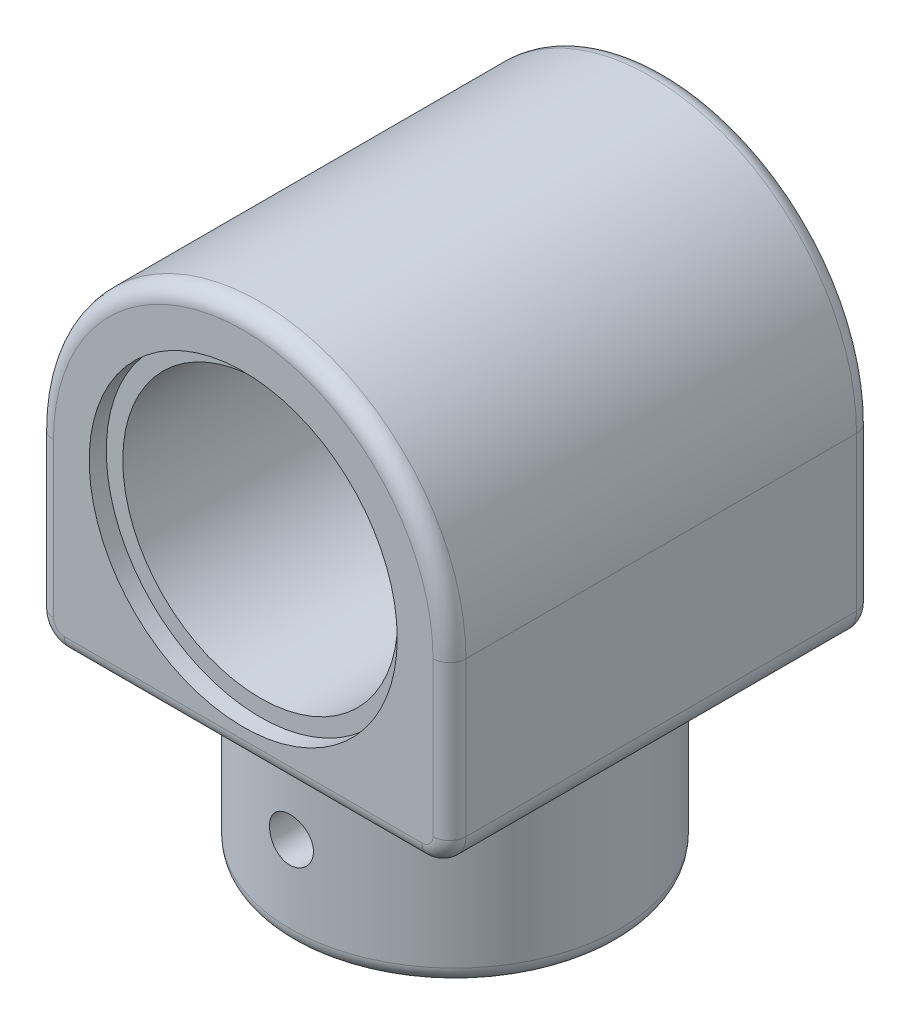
ISO-10303-21;
HEADER;
FILE_DESCRIPTION(('STEP AP214'),'2;1');
FILE_NAME('part.step','',(''),(''),'','','');
FILE_SCHEMA(('AUTOMOTIVE_DESIGN { 1 0 10303 214 1 1 1 1 }'));
ENDSEC;
DATA;
#1=APPLICATION_CONTEXT('core data for automotive mechanical design processes');
#2=APPLICATION_PROTOCOL_DEFINITION('international standard','automotive_design',2000,#1);
#3=PRODUCT_CONTEXT('',#1,'mechanical');
#4=PRODUCT('Part','Part','',(#3));
#5=PRODUCT_RELATED_PRODUCT_CATEGORY('part','',(#4));
#6=PRODUCT_DEFINITION_FORMATION('','',#4);
#7=PRODUCT_DEFINITION_CONTEXT('part definition',#1,'design');
#8=PRODUCT_DEFINITION('design','',#6,#7);
#9=PRODUCT_DEFINITION_SHAPE('','',#8);
#10=(LENGTH_UNIT() NAMED_UNIT(*) SI_UNIT(.MILLI.,.METRE.));
#11=(NAMED_UNIT(*) PLANE_ANGLE_UNIT() SI_UNIT($,.RADIAN.));
#12=(NAMED_UNIT(*) SI_UNIT($,.STERADIAN.) SOLID_ANGLE_UNIT());
#13=UNCERTAINTY_MEASURE_WITH_UNIT(LENGTH_MEASURE(1.E-05),#10,'distance_accuracy_value','');
#14=(GEOMETRIC_REPRESENTATION_CONTEXT(3) GLOBAL_UNCERTAINTY_ASSIGNED_CONTEXT((#13)) GLOBAL_UNIT_ASSIGNED_CONTEXT((#10,
#11,#12)) REPRESENTATION_CONTEXT('',''));
#15=CARTESIAN_POINT('',(0.,0.,0.));
#16=DIRECTION('',(0.,0.,1.));
#17=DIRECTION('',(1.,0.,0.));
#18=AXIS2_PLACEMENT_3D('',#15,#16,#17);
#19=CARTESIAN_POINT('',(0.,-67.,0.));
#20=DIRECTION('',(0.,1.,0.));
#21=DIRECTION('',(0.,0.,1.));
#22=AXIS2_PLACEMENT_3D('',#19,#20,#21);
#23=CYLINDRICAL_SURFACE('',#22,30.);
#24=CARTESIAN_POINT('',(0.,-64.,0.));
#25=DIRECTION('',(0.,-1.,0.));
#26=DIRECTION('',(0.,0.,-1.));
#27=AXIS2_PLACEMENT_3D('',#24,#25,#26);
#28=CIRCLE('',#27,30.);
#29=CARTESIAN_POINT('',(0.,-64.,-30.));
#30=VERTEX_POINT('',#29);
#31=EDGE_CURVE('E303',#30,#30,#28,.F.);
#32=ORIENTED_EDGE('',*,*,#31,.T.);
#33=EDGE_LOOP('',(#32));
#34=FACE_BOUND('',#33,.T.);
#35=CARTESIAN_POINT('',(0.,-36.,0.));
#36=DIRECTION('',(0.,1.,0.));
#37=DIRECTION('',(0.,0.,1.));
#38=AXIS2_PLACEMENT_3D('',#35,#36,#37);
#39=CIRCLE('',#38,30.);
#40=CARTESIAN_POINT('',(-29.5454545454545,-36.,-5.20251051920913));
#41=VERTEX_POINT('',#40);
#42=CARTESIAN_POINT('',(29.5454545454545,-36.,-5.20251051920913));
#43=VERTEX_POINT('',#42);
#44=EDGE_CURVE('E307',#41,#43,#39,.F.);
#45=ORIENTED_EDGE('',*,*,#44,.T.);
#46=CARTESIAN_POINT('',(31.0269999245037,-32.7781032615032,13.4308414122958));
#47=CARTESIAN_POINT('',(27.6032051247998,-31.7226112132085,11.7603257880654));
#48=CARTESIAN_POINT('',(27.4029089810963,-35.6449652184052,12.2098558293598));
#49=CARTESIAN_POINT('',(31.1121655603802,-32.8043348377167,13.1250414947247));
#50=CARTESIAN_POINT('',(27.7015173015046,-31.8191347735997,11.5276477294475));
#51=CARTESIAN_POINT('',(27.5267862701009,-35.6869357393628,11.9318559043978));
#52=CARTESIAN_POINT('',(31.1945679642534,-32.8272685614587,12.8166006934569));
#53=CARTESIAN_POINT('',(27.8004997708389,-31.9094802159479,11.2855429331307));
#54=CARTESIAN_POINT('',(27.6466443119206,-35.7236296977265,11.6514551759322));
#55=CARTESIAN_POINT('',(31.3536311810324,-32.8675069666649,12.1951081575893));
#56=CARTESIAN_POINT('',(27.9956868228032,-32.0766671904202,10.7894789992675));
#57=CARTESIAN_POINT('',(27.8780089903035,-35.7880111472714,11.0864619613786));
#58=CARTESIAN_POINT('',(31.430293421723,-32.8848130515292,11.8820575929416));
#59=CARTESIAN_POINT('',(28.0920627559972,-32.1538529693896,10.535420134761));
#60=CARTESIAN_POINT('',(27.9895177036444,-35.8157008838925,10.8018705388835));
#61=CARTESIAN_POINT('',(31.5776162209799,-32.91475714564,11.252237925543));
#62=CARTESIAN_POINT('',(28.2802828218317,-32.2959814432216,10.0175468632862));
#63=CARTESIAN_POINT('',(28.203805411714,-35.863611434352,10.2293072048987));
#64=CARTESIAN_POINT('',(31.6482838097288,-32.9274006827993,10.9354736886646));
#65=CARTESIAN_POINT('',(28.3723196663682,-32.3612195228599,9.75357980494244));
#66=CARTESIAN_POINT('',(28.3065946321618,-35.8838410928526,9.94133971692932));
#67=CARTESIAN_POINT('',(31.7835927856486,-32.948883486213,10.2983342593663));
#68=CARTESIAN_POINT('',(28.5507615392,-32.4809598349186,9.21717256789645));
#69=CARTESIAN_POINT('',(28.5034076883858,-35.9182135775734,9.36212205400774));
#70=CARTESIAN_POINT('',(31.8482337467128,-32.9577224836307,9.97795881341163));
#71=CARTESIAN_POINT('',(28.637359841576,-32.5356903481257,8.94451139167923));
#72=CARTESIAN_POINT('',(28.5974309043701,-35.9323559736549,9.07087164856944));
#73=CARTESIAN_POINT('',(32.0330805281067,-32.9797052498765,9.01142082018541));
#74=CARTESIAN_POINT('',(28.8857564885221,-32.6848389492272,8.12050905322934));
#75=CARTESIAN_POINT('',(28.866298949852,-35.9675284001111,8.19220074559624));
#76=CARTESIAN_POINT('',(32.1440754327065,-32.9882903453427,8.36042277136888));
#77=CARTESIAN_POINT('',(29.0402981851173,-32.7670838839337,7.55145749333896));
#78=CARTESIAN_POINT('',(29.0277460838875,-35.9812645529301,7.6003843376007));
#79=CARTESIAN_POINT('',(32.3409712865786,-32.9984420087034,7.04838736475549));
#80=CARTESIAN_POINT('',(29.3165684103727,-32.9024516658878,6.39422530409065));
#81=CARTESIAN_POINT('',(29.3141400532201,-35.9975072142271,6.40762487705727));
#82=CARTESIAN_POINT('',(32.4268599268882,-33.0000051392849,6.38734524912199));
#83=CARTESIAN_POINT('',(29.4396147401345,-32.956468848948,5.80350920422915));
#84=CARTESIAN_POINT('',(29.4390689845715,-36.0000082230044,5.80667749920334));
#85=CARTESIAN_POINT('',(32.5519484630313,-32.9999963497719,5.25073441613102));
#86=CARTESIAN_POINT('',(29.6197069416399,-33.0305394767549,4.78087716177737));
#87=CARTESIAN_POINT('',(29.6210159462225,-35.9999941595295,4.77339492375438));
#88=CARTESIAN_POINT('',(32.5974656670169,-32.9992015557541,4.77692065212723));
#89=CARTESIAN_POINT('',(29.6857316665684,-33.0560182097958,4.35285018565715));
#90=CARTESIAN_POINT('',(29.6872227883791,-35.9987224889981,4.34265513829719));
#91=CARTESIAN_POINT('',(32.6755619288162,-32.997070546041,3.82653372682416));
#92=CARTESIAN_POINT('',(29.7991677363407,-33.0981729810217,3.4923513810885));
#93=CARTESIAN_POINT('',(29.8008173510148,-35.9953128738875,3.47866702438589));
#94=CARTESIAN_POINT('',(32.708140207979,-32.9957342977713,3.34996040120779));
#95=CARTESIAN_POINT('',(29.8468599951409,-33.1149675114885,3.05883763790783));
#96=CARTESIAN_POINT('',(29.8482039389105,-35.9931748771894,3.0454185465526));
#97=CARTESIAN_POINT('',(32.7602942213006,-32.9932881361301,2.39494132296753));
#98=CARTESIAN_POINT('',(29.9231821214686,-33.1412057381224,2.18926831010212));
#99=CARTESIAN_POINT('',(29.9240643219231,-35.9892610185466,2.17721938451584));
#100=CARTESIAN_POINT('',(32.7798684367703,-32.9921782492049,1.91649535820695));
#101=CARTESIAN_POINT('',(29.9520002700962,-33.1507180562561,1.75214046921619));
#102=CARTESIAN_POINT('',(29.9525359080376,-35.9874851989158,1.74226850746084));
#103=CARTESIAN_POINT('',(32.8059711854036,-32.9906465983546,0.958699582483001));
#104=CARTESIAN_POINT('',(29.9903610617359,-33.1632744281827,0.877218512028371));
#105=CARTESIAN_POINT('',(29.9905035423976,-35.9850345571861,0.871545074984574));
#106=CARTESIAN_POINT('',(32.8125,-32.9902248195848,0.4793497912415));
#107=CARTESIAN_POINT('',(30.,-33.1663504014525,0.438335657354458));
#108=CARTESIAN_POINT('',(30.,-35.9843597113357,0.435772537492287));
#109=CARTESIAN_POINT('',(32.8125,-32.9902248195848,-0.479349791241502));
#110=CARTESIAN_POINT('',(30.,-33.1663504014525,-0.43833565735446));
#111=CARTESIAN_POINT('',(30.,-35.9843597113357,-0.435772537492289));
#112=CARTESIAN_POINT('',(32.8059711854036,-32.9906465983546,-0.958699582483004));
#113=CARTESIAN_POINT('',(29.9903610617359,-33.1632744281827,-0.877218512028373));
#114=CARTESIAN_POINT('',(29.9905035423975,-35.9850345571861,-0.871545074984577));
#115=CARTESIAN_POINT('',(32.7798684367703,-32.9921782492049,-1.91649535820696));
#116=CARTESIAN_POINT('',(29.9520002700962,-33.1507180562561,-1.75214046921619));
#117=CARTESIAN_POINT('',(29.9525359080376,-35.9874851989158,-1.74226850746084));
#118=CARTESIAN_POINT('',(32.7602942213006,-32.9932881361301,-2.39494132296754));
#119=CARTESIAN_POINT('',(29.9231821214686,-33.1412057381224,-2.18926831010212));
#120=CARTESIAN_POINT('',(29.9240643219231,-35.9892610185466,-2.17721938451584));
#121=CARTESIAN_POINT('',(32.708140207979,-32.9957342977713,-3.34996040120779));
#122=CARTESIAN_POINT('',(29.8468599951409,-33.1149675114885,-3.05883763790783));
#123=CARTESIAN_POINT('',(29.8482039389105,-35.9931748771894,-3.0454185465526));
#124=CARTESIAN_POINT('',(32.6755619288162,-32.997070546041,-3.82653372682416));
#125=CARTESIAN_POINT('',(29.7991677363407,-33.0981729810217,-3.4923513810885));
#126=CARTESIAN_POINT('',(29.8008173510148,-35.9953128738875,-3.47866702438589));
#127=CARTESIAN_POINT('',(32.5974656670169,-32.9992015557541,-4.77692065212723));
#128=CARTESIAN_POINT('',(29.6857316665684,-33.0560182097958,-4.35285018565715));
#129=CARTESIAN_POINT('',(29.6872227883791,-35.9987224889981,-4.34265513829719));
#130=CARTESIAN_POINT('',(32.5519484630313,-32.9999963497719,-5.25073441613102));
#131=CARTESIAN_POINT('',(29.6197069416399,-33.0305394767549,-4.78087716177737));
#132=CARTESIAN_POINT('',(29.6210159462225,-35.9999941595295,-4.77339492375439));
#133=CARTESIAN_POINT('',(32.4268599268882,-33.0000051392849,-6.38734524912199));
#134=CARTESIAN_POINT('',(29.4396147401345,-32.956468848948,-5.80350920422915));
#135=CARTESIAN_POINT('',(29.4390689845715,-36.0000082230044,-5.80667749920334));
#136=CARTESIAN_POINT('',(32.3409712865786,-32.9984420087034,-7.04838736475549));
#137=CARTESIAN_POINT('',(29.3165684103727,-32.9024516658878,-6.39422530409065));
#138=CARTESIAN_POINT('',(29.3141400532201,-35.9975072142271,-6.40762487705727));
#139=CARTESIAN_POINT('',(32.1440754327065,-32.9882903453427,-8.36042277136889));
#140=CARTESIAN_POINT('',(29.0402981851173,-32.7670838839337,-7.55145749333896));
#141=CARTESIAN_POINT('',(29.0277460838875,-35.9812645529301,-7.6003843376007));
#142=CARTESIAN_POINT('',(32.0330805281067,-32.9797052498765,-9.01142082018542));
#143=CARTESIAN_POINT('',(28.8857564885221,-32.6848389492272,-8.12050905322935));
#144=CARTESIAN_POINT('',(28.866298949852,-35.9675284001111,-8.19220074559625));
#145=CARTESIAN_POINT('',(31.8482337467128,-32.9577224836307,-9.97795881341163));
#146=CARTESIAN_POINT('',(28.637359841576,-32.5356903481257,-8.94451139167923));
#147=CARTESIAN_POINT('',(28.5974309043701,-35.9323559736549,-9.07087164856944));
#148=CARTESIAN_POINT('',(31.7835927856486,-32.948883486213,-10.2983342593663));
#149=CARTESIAN_POINT('',(28.5507615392,-32.4809598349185,-9.21717256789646));
#150=CARTESIAN_POINT('',(28.5034076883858,-35.9182135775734,-9.36212205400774));
#151=CARTESIAN_POINT('',(31.6482838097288,-32.9274006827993,-10.9354736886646));
#152=CARTESIAN_POINT('',(28.3723196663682,-32.3612195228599,-9.75357980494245));
#153=CARTESIAN_POINT('',(28.3065946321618,-35.8838410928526,-9.94133971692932));
#154=CARTESIAN_POINT('',(31.5776162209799,-32.91475714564,-11.252237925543));
#155=CARTESIAN_POINT('',(28.2802828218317,-32.2959814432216,-10.0175468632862));
#156=CARTESIAN_POINT('',(28.203805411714,-35.863611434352,-10.2293072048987));
#157=CARTESIAN_POINT('',(31.430293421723,-32.8848130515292,-11.8820575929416));
#158=CARTESIAN_POINT('',(28.0920627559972,-32.1538529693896,-10.535420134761));
#159=CARTESIAN_POINT('',(27.9895177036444,-35.8157008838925,-10.8018705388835));
#160=CARTESIAN_POINT('',(31.3536311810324,-32.8675069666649,-12.1951081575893));
#161=CARTESIAN_POINT('',(27.9956868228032,-32.0766671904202,-10.7894789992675));
#162=CARTESIAN_POINT('',(27.8780089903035,-35.7880111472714,-11.0864619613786));
#163=CARTESIAN_POINT('',(31.1945679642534,-32.8272685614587,-12.8166006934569));
#164=CARTESIAN_POINT('',(27.8004997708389,-31.9094802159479,-11.2855429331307));
#165=CARTESIAN_POINT('',(27.6466443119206,-35.7236296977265,-11.6514551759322));
#166=CARTESIAN_POINT('',(31.1121655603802,-32.8043348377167,-13.1250414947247));
#167=CARTESIAN_POINT('',(27.7015173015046,-31.8191347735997,-11.5276477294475));
#168=CARTESIAN_POINT('',(27.5267862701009,-35.6869357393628,-11.9318559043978));
#169=CARTESIAN_POINT('',(31.0269999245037,-32.7781032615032,-13.4308414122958));
#170=CARTESIAN_POINT('',(27.6032051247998,-31.7226112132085,-11.7603257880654));
#171=CARTESIAN_POINT('',(27.4029089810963,-35.6449652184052,-12.2098558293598));
#172=(BOUNDED_SURFACE() B_SPLINE_SURFACE(3,2,((#46,#47,#48),(#49,#50,#51),(#52,#53,#54),(#55,
#56,#57),(#58,#59,#60),(#61,#62,#63),(#64,#65,#66),(#67,#68,#69),(#70,#71,#72),(#73,#74,#75),
(#76,#77,#78),(#79,#80,#81),(#82,#83,#84),(#85,#86,#87),(#88,#89,#90),(#91,#92,#93),(#94,#95,
#96),(#97,#98,#99),(#100,#101,#102),(#103,#104,#105),(#106,#107,#108),(#109,#110,#111),(#112,
#113,#114),(#115,#116,#117),(#118,#119,#120),(#121,#122,#123),(#124,#125,#126),(#127,#128,#129),
(#130,#131,#132),(#133,#134,#135),(#136,#137,#138),(#139,#140,#141),(#142,#143,#144),(#145,#146,
#147),(#148,#149,#150),(#151,#152,#153),(#154,#155,#156),(#157,#158,#159),(#160,#161,#162),
(#163,#164,#165),(#166,#167,#168),(#169,#170,#171)),.UNSPECIFIED.,.F.,.F.,
.F.) B_SPLINE_SURFACE_WITH_KNOTS((4,2,2,2,2,2,2,2,2,2,2,2,2,2,2,2,2,2,2,2,4),(3,3),(0.,
1.01206920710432,2.02388583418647,3.03449896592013,4.04518349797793,6.068397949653,
8.09260267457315,9.53031417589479,10.968112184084,12.4060780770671,13.8440129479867,
15.2819478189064,16.7199137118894,18.1577117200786,19.5954232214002,21.6196279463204,
23.6428423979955,24.6535269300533,25.6641400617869,26.6759566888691,27.6880258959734),(0.,1.),
.UNSPECIFIED.) GEOMETRIC_REPRESENTATION_ITEM() RATIONAL_B_SPLINE_SURFACE(((1.,0.604526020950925,
1.),(1.,0.610457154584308,1.),(1.,0.61619582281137,1.),(1.,0.627273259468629,1.),(1.,
0.632612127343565,1.),(1.,0.642871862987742,1.),(1.,0.647793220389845,1.),(1.,0.657216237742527,
1.),(1.,0.661717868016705,1.),(1.,0.674590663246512,1.),(1.,0.682320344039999,1.),(1.,
0.69603211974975,1.),(1.,0.702013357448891,1.),(1.,0.710724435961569,1.),(1.,0.713894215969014,
1.),(1.,0.719332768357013,1.),(1.,0.721601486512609,1.),(1.,0.725233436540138,1.),(1.,
0.72659656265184,1.),(1.,0.728414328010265,1.),(1.,0.728868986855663,1.),(1.,0.728868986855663,
1.),(1.,0.728414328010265,1.),(1.,0.72659656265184,1.),(1.,0.725233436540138,1.),(1.,
0.721601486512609,1.),(1.,0.719332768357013,1.),(1.,0.713894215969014,1.),(1.,0.710724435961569,
1.),(1.,0.702013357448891,1.),(1.,0.69603211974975,1.),(1.,0.682320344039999,1.),(1.,
0.674590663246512,1.),(1.,0.661717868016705,1.),(1.,0.657216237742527,1.),(1.,0.647793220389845,
1.),(1.,0.642871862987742,1.),(1.,0.632612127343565,1.),(1.,0.627273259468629,1.),(1.,
0.61619582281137,1.),(1.,0.610457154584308,1.),(1.,0.604526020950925,1.))) REPRESENTATION_ITEM('') SURFACE());
#173=CARTESIAN_POINT('',(27.4029089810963,-35.6449652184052,-12.2098558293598));
#174=CARTESIAN_POINT('',(27.5267862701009,-35.6869357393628,-11.9318559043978));
#175=CARTESIAN_POINT('',(27.6466443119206,-35.7236296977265,-11.6514551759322));
#176=CARTESIAN_POINT('',(27.8780089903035,-35.7880111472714,-11.0864619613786));
#177=CARTESIAN_POINT('',(27.9895177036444,-35.8157008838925,-10.8018705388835));
#178=CARTESIAN_POINT('',(28.203805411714,-35.863611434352,-10.2293072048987));
#179=CARTESIAN_POINT('',(28.3065946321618,-35.8838410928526,-9.94133971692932));
#180=CARTESIAN_POINT('',(28.5034076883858,-35.9182135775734,-9.36212205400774));
#181=CARTESIAN_POINT('',(28.5974309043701,-35.9323559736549,-9.07087164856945));
#182=CARTESIAN_POINT('',(28.866298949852,-35.9675284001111,-8.19220074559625));
#183=CARTESIAN_POINT('',(29.0277460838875,-35.9812645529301,-7.6003843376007));
#184=CARTESIAN_POINT('',(29.3141400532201,-35.9975072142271,-6.40762487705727));
#185=CARTESIAN_POINT('',(29.4390689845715,-36.0000082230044,-5.80667749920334));
#186=CARTESIAN_POINT('',(29.6210159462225,-35.9999941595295,-4.77339492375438));
#187=CARTESIAN_POINT('',(29.6872227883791,-35.9987224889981,-4.34265513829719));
#188=CARTESIAN_POINT('',(29.8008173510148,-35.9953128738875,-3.47866702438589));
#189=CARTESIAN_POINT('',(29.8482039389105,-35.9931748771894,-3.0454185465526));
#190=CARTESIAN_POINT('',(29.9240643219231,-35.9892610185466,-2.17721938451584));
#191=CARTESIAN_POINT('',(29.9525359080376,-35.9874851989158,-1.74226850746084));
#192=CARTESIAN_POINT('',(29.9905035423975,-35.9850345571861,-0.871545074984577));
#193=CARTESIAN_POINT('',(30.,-35.9843597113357,-0.435772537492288));
#194=CARTESIAN_POINT('',(30.,-35.9843597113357,0.435772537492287));
#195=CARTESIAN_POINT('',(29.9905035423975,-35.9850345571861,0.871545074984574));
#196=CARTESIAN_POINT('',(29.9525359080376,-35.9874851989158,1.74226850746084));
#197=CARTESIAN_POINT('',(29.9240643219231,-35.9892610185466,2.17721938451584));
#198=CARTESIAN_POINT('',(29.8482039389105,-35.9931748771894,3.0454185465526));
#199=CARTESIAN_POINT('',(29.8008173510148,-35.9953128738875,3.47866702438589));
#200=CARTESIAN_POINT('',(29.6872227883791,-35.9987224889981,4.34265513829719));
#201=CARTESIAN_POINT('',(29.6210159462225,-35.9999941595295,4.77339492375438));
#202=CARTESIAN_POINT('',(29.4390689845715,-36.0000082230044,5.80667749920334));
#203=CARTESIAN_POINT('',(29.3141400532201,-35.9975072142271,6.40762487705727));
#204=CARTESIAN_POINT('',(29.0277460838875,-35.9812645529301,7.6003843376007));
#205=CARTESIAN_POINT('',(28.866298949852,-35.9675284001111,8.19220074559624));
#206=CARTESIAN_POINT('',(28.5974309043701,-35.9323559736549,9.07087164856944));
#207=CARTESIAN_POINT('',(28.5034076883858,-35.9182135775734,9.36212205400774));
#208=CARTESIAN_POINT('',(28.3065946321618,-35.8838410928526,9.94133971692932));
#209=CARTESIAN_POINT('',(28.203805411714,-35.863611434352,10.2293072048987));
#210=CARTESIAN_POINT('',(27.9895177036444,-35.8157008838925,10.8018705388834));
#211=CARTESIAN_POINT('',(27.8780089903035,-35.7880111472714,11.0864619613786));
#212=CARTESIAN_POINT('',(27.6466443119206,-35.7236296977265,11.6514551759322));
#213=CARTESIAN_POINT('',(27.5267862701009,-35.6869357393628,11.9318559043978));
#214=CARTESIAN_POINT('',(27.4029089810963,-35.6449652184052,12.2098558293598));
#215=B_SPLINE_CURVE_WITH_KNOTS('',3,(#173,#174,#175,#176,#177,#178,#179,#180,#181,#182,#183,
#184,#185,#186,#187,#188,#189,#190,#191,#192,#193,#194,#195,#196,#197,#198,#199,#200,#201,#202,
#203,#204,#205,#206,#207,#208,#209,#210,#211,#212,#213,#214),.UNSPECIFIED.,.F.,.F.,(4,2,2,2,2,2,
2,2,2,2,2,2,2,2,2,2,2,2,2,2,4),(0.,1.01206920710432,2.02388583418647,3.03449896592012,
4.04518349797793,6.068397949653,8.09260267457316,9.5303141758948,10.968112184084,
12.4060780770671,13.8440129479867,15.2819478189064,16.7199137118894,18.1577117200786,
19.5954232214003,21.6196279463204,23.6428423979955,24.6535269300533,25.6641400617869,
26.6759566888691,27.6880258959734),.UNSPECIFIED.);
#216=CARTESIAN_POINT('',(29.5454545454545,-36.,5.20251051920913));
#217=VERTEX_POINT('',#216);
#218=EDGE_CURVE('E433',#43,#217,#215,.T.);
#219=ORIENTED_EDGE('',*,*,#218,.T.);
#220=CARTESIAN_POINT('',(0.,-36.,0.));
#221=DIRECTION('',(0.,1.,0.));
#222=DIRECTION('',(0.,0.,1.));
#223=AXIS2_PLACEMENT_3D('',#220,#221,#222);
#224=CIRCLE('',#223,30.);
#225=CARTESIAN_POINT('',(-29.5454545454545,-36.,5.20251051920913));
#226=VERTEX_POINT('',#225);
#227=EDGE_CURVE('E438',#217,#226,#224,.F.);
#228=ORIENTED_EDGE('',*,*,#227,.T.);
#229=CARTESIAN_POINT('',(-31.0269999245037,-32.7781032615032,-13.4308414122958));
#230=CARTESIAN_POINT('',(-27.6032051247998,-31.7226112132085,-11.7603257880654));
#231=CARTESIAN_POINT('',(-27.4029089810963,-35.6449652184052,-12.2098558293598));
#232=CARTESIAN_POINT('',(-31.1121655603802,-32.8043348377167,-13.1250414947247));
#233=CARTESIAN_POINT('',(-27.7015173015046,-31.8191347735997,-11.5276477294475));
#234=CARTESIAN_POINT('',(-27.5267862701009,-35.6869357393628,-11.9318559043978));
#235=CARTESIAN_POINT('',(-31.1945679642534,-32.8272685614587,-12.8166006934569));
#236=CARTESIAN_POINT('',(-27.8004997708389,-31.9094802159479,-11.2855429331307));
#237=CARTESIAN_POINT('',(-27.6466443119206,-35.7236296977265,-11.6514551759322));
#238=CARTESIAN_POINT('',(-31.3536311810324,-32.8675069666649,-12.1951081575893));
#239=CARTESIAN_POINT('',(-27.9956868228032,-32.0766671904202,-10.7894789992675));
#240=CARTESIAN_POINT('',(-27.8780089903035,-35.7880111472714,-11.0864619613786));
#241=CARTESIAN_POINT('',(-31.430293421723,-32.8848130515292,-11.8820575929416));
#242=CARTESIAN_POINT('',(-28.0920627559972,-32.1538529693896,-10.535420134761));
#243=CARTESIAN_POINT('',(-27.9895177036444,-35.8157008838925,-10.8018705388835));
#244=CARTESIAN_POINT('',(-31.5776162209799,-32.91475714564,-11.252237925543));
#245=CARTESIAN_POINT('',(-28.2802828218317,-32.2959814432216,-10.0175468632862));
#246=CARTESIAN_POINT('',(-28.203805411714,-35.863611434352,-10.2293072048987));
#247=CARTESIAN_POINT('',(-31.6482838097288,-32.9274006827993,-10.9354736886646));
#248=CARTESIAN_POINT('',(-28.3723196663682,-32.3612195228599,-9.75357980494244));
#249=CARTESIAN_POINT('',(-28.3065946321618,-35.8838410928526,-9.94133971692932));
#250=CARTESIAN_POINT('',(-31.7835927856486,-32.948883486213,-10.2983342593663));
#251=CARTESIAN_POINT('',(-28.5507615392,-32.4809598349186,-9.21717256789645));
#252=CARTESIAN_POINT('',(-28.5034076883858,-35.9182135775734,-9.36212205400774));
#253=CARTESIAN_POINT('',(-31.8482337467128,-32.9577224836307,-9.97795881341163));
#254=CARTESIAN_POINT('',(-28.637359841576,-32.5356903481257,-8.94451139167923));
#255=CARTESIAN_POINT('',(-28.5974309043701,-35.9323559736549,-9.07087164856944));
#256=CARTESIAN_POINT('',(-32.0330805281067,-32.9797052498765,-9.01142082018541));
#257=CARTESIAN_POINT('',(-28.8857564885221,-32.6848389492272,-8.12050905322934));
#258=CARTESIAN_POINT('',(-28.866298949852,-35.9675284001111,-8.19220074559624));
#259=CARTESIAN_POINT('',(-32.1440754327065,-32.9882903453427,-8.36042277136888));
#260=CARTESIAN_POINT('',(-29.0402981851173,-32.7670838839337,-7.55145749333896));
#261=CARTESIAN_POINT('',(-29.0277460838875,-35.9812645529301,-7.6003843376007));
#262=CARTESIAN_POINT('',(-32.3409712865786,-32.9984420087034,-7.04838736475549));
#263=CARTESIAN_POINT('',(-29.3165684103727,-32.9024516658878,-6.39422530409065));
#264=CARTESIAN_POINT('',(-29.3141400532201,-35.9975072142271,-6.40762487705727));
#265=CARTESIAN_POINT('',(-32.4268599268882,-33.0000051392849,-6.38734524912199));
#266=CARTESIAN_POINT('',(-29.4396147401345,-32.956468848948,-5.80350920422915));
#267=CARTESIAN_POINT('',(-29.4390689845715,-36.0000082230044,-5.80667749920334));
#268=CARTESIAN_POINT('',(-32.5519484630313,-32.9999963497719,-5.25073441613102));
#269=CARTESIAN_POINT('',(-29.6197069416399,-33.0305394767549,-4.78087716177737));
#270=CARTESIAN_POINT('',(-29.6210159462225,-35.9999941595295,-4.77339492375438));
#271=CARTESIAN_POINT('',(-32.5974656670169,-32.9992015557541,-4.77692065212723));
#272=CARTESIAN_POINT('',(-29.6857316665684,-33.0560182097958,-4.35285018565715));
#273=CARTESIAN_POINT('',(-29.6872227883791,-35.9987224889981,-4.34265513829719));
#274=CARTESIAN_POINT('',(-32.6755619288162,-32.997070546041,-3.82653372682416));
#275=CARTESIAN_POINT('',(-29.7991677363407,-33.0981729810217,-3.4923513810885));
#276=CARTESIAN_POINT('',(-29.8008173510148,-35.9953128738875,-3.47866702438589));
#277=CARTESIAN_POINT('',(-32.708140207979,-32.9957342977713,-3.34996040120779));
#278=CARTESIAN_POINT('',(-29.8468599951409,-33.1149675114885,-3.05883763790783));
#279=CARTESIAN_POINT('',(-29.8482039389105,-35.9931748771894,-3.0454185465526));
#280=CARTESIAN_POINT('',(-32.7602942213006,-32.9932881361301,-2.39494132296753));
#281=CARTESIAN_POINT('',(-29.9231821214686,-33.1412057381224,-2.18926831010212));
#282=CARTESIAN_POINT('',(-29.9240643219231,-35.9892610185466,-2.17721938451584));
#283=CARTESIAN_POINT('',(-32.7798684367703,-32.9921782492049,-1.91649535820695));
#284=CARTESIAN_POINT('',(-29.9520002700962,-33.1507180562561,-1.75214046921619));
#285=CARTESIAN_POINT('',(-29.9525359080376,-35.9874851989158,-1.74226850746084));
#286=CARTESIAN_POINT('',(-32.8059711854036,-32.9906465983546,-0.958699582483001));
#287=CARTESIAN_POINT('',(-29.9903610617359,-33.1632744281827,-0.877218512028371));
#288=CARTESIAN_POINT('',(-29.9905035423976,-35.9850345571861,-0.871545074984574));
#289=CARTESIAN_POINT('',(-32.8125,-32.9902248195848,-0.4793497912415));
#290=CARTESIAN_POINT('',(-30.,-33.1663504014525,-0.438335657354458));
#291=CARTESIAN_POINT('',(-30.,-35.9843597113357,-0.435772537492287));
#292=CARTESIAN_POINT('',(-32.8125,-32.9902248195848,0.479349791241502));
#293=CARTESIAN_POINT('',(-30.,-33.1663504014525,0.43833565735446));
#294=CARTESIAN_POINT('',(-30.,-35.9843597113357,0.435772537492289));
#295=CARTESIAN_POINT('',(-32.8059711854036,-32.9906465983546,0.958699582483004));
#296=CARTESIAN_POINT('',(-29.9903610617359,-33.1632744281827,0.877218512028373));
#297=CARTESIAN_POINT('',(-29.9905035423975,-35.9850345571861,0.871545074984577));
#298=CARTESIAN_POINT('',(-32.7798684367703,-32.9921782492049,1.91649535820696));
#299=CARTESIAN_POINT('',(-29.9520002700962,-33.1507180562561,1.75214046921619));
#300=CARTESIAN_POINT('',(-29.9525359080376,-35.9874851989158,1.74226850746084));
#301=CARTESIAN_POINT('',(-32.7602942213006,-32.9932881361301,2.39494132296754));
#302=CARTESIAN_POINT('',(-29.9231821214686,-33.1412057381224,2.18926831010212));
#303=CARTESIAN_POINT('',(-29.9240643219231,-35.9892610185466,2.17721938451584));
#304=CARTESIAN_POINT('',(-32.708140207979,-32.9957342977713,3.34996040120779));
#305=CARTESIAN_POINT('',(-29.8468599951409,-33.1149675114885,3.05883763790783));
#306=CARTESIAN_POINT('',(-29.8482039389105,-35.9931748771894,3.0454185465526));
#307=CARTESIAN_POINT('',(-32.6755619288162,-32.997070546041,3.82653372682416));
#308=CARTESIAN_POINT('',(-29.7991677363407,-33.0981729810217,3.4923513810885));
#309=CARTESIAN_POINT('',(-29.8008173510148,-35.9953128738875,3.47866702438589));
#310=CARTESIAN_POINT('',(-32.5974656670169,-32.9992015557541,4.77692065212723));
#311=CARTESIAN_POINT('',(-29.6857316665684,-33.0560182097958,4.35285018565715));
#312=CARTESIAN_POINT('',(-29.6872227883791,-35.9987224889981,4.34265513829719));
#313=CARTESIAN_POINT('',(-32.5519484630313,-32.9999963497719,5.25073441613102));
#314=CARTESIAN_POINT('',(-29.6197069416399,-33.0305394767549,4.78087716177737));
#315=CARTESIAN_POINT('',(-29.6210159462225,-35.9999941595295,4.77339492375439));
#316=CARTESIAN_POINT('',(-32.4268599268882,-33.0000051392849,6.38734524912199));
#317=CARTESIAN_POINT('',(-29.4396147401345,-32.956468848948,5.80350920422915));
#318=CARTESIAN_POINT('',(-29.4390689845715,-36.0000082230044,5.80667749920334));
#319=CARTESIAN_POINT('',(-32.3409712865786,-32.9984420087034,7.04838736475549));
#320=CARTESIAN_POINT('',(-29.3165684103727,-32.9024516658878,6.39422530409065));
#321=CARTESIAN_POINT('',(-29.3141400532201,-35.9975072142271,6.40762487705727));
#322=CARTESIAN_POINT('',(-32.1440754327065,-32.9882903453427,8.36042277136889));
#323=CARTESIAN_POINT('',(-29.0402981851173,-32.7670838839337,7.55145749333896));
#324=CARTESIAN_POINT('',(-29.0277460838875,-35.9812645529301,7.6003843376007));
#325=CARTESIAN_POINT('',(-32.0330805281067,-32.9797052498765,9.01142082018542));
#326=CARTESIAN_POINT('',(-28.8857564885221,-32.6848389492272,8.12050905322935));
#327=CARTESIAN_POINT('',(-28.866298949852,-35.9675284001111,8.19220074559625));
#328=CARTESIAN_POINT('',(-31.8482337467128,-32.9577224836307,9.97795881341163));
#329=CARTESIAN_POINT('',(-28.637359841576,-32.5356903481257,8.94451139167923));
#330=CARTESIAN_POINT('',(-28.5974309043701,-35.9323559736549,9.07087164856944));
#331=CARTESIAN_POINT('',(-31.7835927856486,-32.948883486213,10.2983342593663));
#332=CARTESIAN_POINT('',(-28.5507615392,-32.4809598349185,9.21717256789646));
#333=CARTESIAN_POINT('',(-28.5034076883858,-35.9182135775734,9.36212205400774));
#334=CARTESIAN_POINT('',(-31.6482838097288,-32.9274006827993,10.9354736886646));
#335=CARTESIAN_POINT('',(-28.3723196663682,-32.3612195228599,9.75357980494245));
#336=CARTESIAN_POINT('',(-28.3065946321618,-35.8838410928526,9.94133971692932));
#337=CARTESIAN_POINT('',(-31.5776162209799,-32.91475714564,11.252237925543));
#338=CARTESIAN_POINT('',(-28.2802828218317,-32.2959814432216,10.0175468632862));
#339=CARTESIAN_POINT('',(-28.203805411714,-35.863611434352,10.2293072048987));
#340=CARTESIAN_POINT('',(-31.430293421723,-32.8848130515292,11.8820575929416));
#341=CARTESIAN_POINT('',(-28.0920627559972,-32.1538529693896,10.535420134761));
#342=CARTESIAN_POINT('',(-27.9895177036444,-35.8157008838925,10.8018705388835));
#343=CARTESIAN_POINT('',(-31.3536311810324,-32.8675069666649,12.1951081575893));
#344=CARTESIAN_POINT('',(-27.9956868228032,-32.0766671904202,10.7894789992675));
#345=CARTESIAN_POINT('',(-27.8780089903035,-35.7880111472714,11.0864619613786));
#346=CARTESIAN_POINT('',(-31.1945679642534,-32.8272685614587,12.8166006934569));
#347=CARTESIAN_POINT('',(-27.8004997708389,-31.9094802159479,11.2855429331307));
#348=CARTESIAN_POINT('',(-27.6466443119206,-35.7236296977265,11.6514551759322));
#349=CARTESIAN_POINT('',(-31.1121655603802,-32.8043348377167,13.1250414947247));
#350=CARTESIAN_POINT('',(-27.7015173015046,-31.8191347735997,11.5276477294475));
#351=CARTESIAN_POINT('',(-27.5267862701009,-35.6869357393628,11.9318559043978));
#352=CARTESIAN_POINT('',(-31.0269999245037,-32.7781032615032,13.4308414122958));
#353=CARTESIAN_POINT('',(-27.6032051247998,-31.7226112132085,11.7603257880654));
#354=CARTESIAN_POINT('',(-27.4029089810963,-35.6449652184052,12.2098558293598));
#355=(BOUNDED_SURFACE() B_SPLINE_SURFACE(3,2,((#229,#230,#231),(#232,#233,#234),(#235,#236,
#237),(#238,#239,#240),(#241,#242,#243),(#244,#245,#246),(#247,#248,#249),(#250,#251,#252),
(#253,#254,#255),(#256,#257,#258),(#259,#260,#261),(#262,#263,#264),(#265,#266,#267),(#268,#269,
#270),(#271,#272,#273),(#274,#275,#276),(#277,#278,#279),(#280,#281,#282),(#283,#284,#285),
(#286,#287,#288),(#289,#290,#291),(#292,#293,#294),(#295,#296,#297),(#298,#299,#300),(#301,#302,
#303),(#304,#305,#306),(#307,#308,#309),(#310,#311,#312),(#313,#314,#315),(#316,#317,#318),
(#319,#320,#321),(#322,#323,#324),(#325,#326,#327),(#328,#329,#330),(#331,#332,#333),(#334,#335,
#336),(#337,#338,#339),(#340,#341,#342),(#343,#344,#345),(#346,#347,#348),(#349,#350,#351),
(#352,#353,#354)),.UNSPECIFIED.,.F.,.F.,.F.) B_SPLINE_SURFACE_WITH_KNOTS((4,2,2,2,2,2,2,2,2,2,2,
2,2,2,2,2,2,2,2,2,4),(3,3),(0.,1.01206920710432,2.02388583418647,3.03449896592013,
4.04518349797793,6.068397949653,8.09260267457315,9.53031417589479,10.968112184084,
12.4060780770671,13.8440129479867,15.2819478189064,16.7199137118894,18.1577117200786,
19.5954232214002,21.6196279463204,23.6428423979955,24.6535269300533,25.6641400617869,
26.6759566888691,27.6880258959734),(0.,1.),
.UNSPECIFIED.) GEOMETRIC_REPRESENTATION_ITEM() RATIONAL_B_SPLINE_SURFACE(((1.,0.604526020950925,
1.),(1.,0.610457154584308,1.),(1.,0.61619582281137,1.),(1.,0.627273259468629,1.),(1.,
0.632612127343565,1.),(1.,0.642871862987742,1.),(1.,0.647793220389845,1.),(1.,0.657216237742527,
1.),(1.,0.661717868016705,1.),(1.,0.674590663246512,1.),(1.,0.682320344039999,1.),(1.,
0.69603211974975,1.),(1.,0.702013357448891,1.),(1.,0.710724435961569,1.),(1.,0.713894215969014,
1.),(1.,0.719332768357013,1.),(1.,0.721601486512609,1.),(1.,0.725233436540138,1.),(1.,
0.72659656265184,1.),(1.,0.728414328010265,1.),(1.,0.728868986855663,1.),(1.,0.728868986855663,
1.),(1.,0.728414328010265,1.),(1.,0.72659656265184,1.),(1.,0.725233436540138,1.),(1.,
0.721601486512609,1.),(1.,0.719332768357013,1.),(1.,0.713894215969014,1.),(1.,0.710724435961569,
1.),(1.,0.702013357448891,1.),(1.,0.69603211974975,1.),(1.,0.682320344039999,1.),(1.,
0.674590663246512,1.),(1.,0.661717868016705,1.),(1.,0.657216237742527,1.),(1.,0.647793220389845,
1.),(1.,0.642871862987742,1.),(1.,0.632612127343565,1.),(1.,0.627273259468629,1.),(1.,
0.61619582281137,1.),(1.,0.610457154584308,1.),(1.,0.604526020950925,1.))) REPRESENTATION_ITEM('') SURFACE());
#356=CARTESIAN_POINT('',(-27.4029089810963,-35.6449652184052,12.2098558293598));
#357=CARTESIAN_POINT('',(-27.5267862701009,-35.6869357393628,11.9318559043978));
#358=CARTESIAN_POINT('',(-27.6466443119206,-35.7236296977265,11.6514551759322));
#359=CARTESIAN_POINT('',(-27.8780089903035,-35.7880111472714,11.0864619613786));
#360=CARTESIAN_POINT('',(-27.9895177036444,-35.8157008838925,10.8018705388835));
#361=CARTESIAN_POINT('',(-28.203805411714,-35.863611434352,10.2293072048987));
#362=CARTESIAN_POINT('',(-28.3065946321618,-35.8838410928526,9.94133971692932));
#363=CARTESIAN_POINT('',(-28.5034076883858,-35.9182135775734,9.36212205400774));
#364=CARTESIAN_POINT('',(-28.5974309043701,-35.9323559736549,9.07087164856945));
#365=CARTESIAN_POINT('',(-28.866298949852,-35.9675284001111,8.19220074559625));
#366=CARTESIAN_POINT('',(-29.0277460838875,-35.9812645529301,7.6003843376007));
#367=CARTESIAN_POINT('',(-29.3141400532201,-35.9975072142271,6.40762487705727));
#368=CARTESIAN_POINT('',(-29.4390689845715,-36.0000082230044,5.80667749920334));
#369=CARTESIAN_POINT('',(-29.6210159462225,-35.9999941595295,4.77339492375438));
#370=CARTESIAN_POINT('',(-29.6872227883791,-35.9987224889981,4.34265513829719));
#371=CARTESIAN_POINT('',(-29.8008173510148,-35.9953128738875,3.47866702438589));
#372=CARTESIAN_POINT('',(-29.8482039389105,-35.9931748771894,3.0454185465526));
#373=CARTESIAN_POINT('',(-29.9240643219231,-35.9892610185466,2.17721938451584));
#374=CARTESIAN_POINT('',(-29.9525359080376,-35.9874851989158,1.74226850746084));
#375=CARTESIAN_POINT('',(-29.9905035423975,-35.9850345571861,0.871545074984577));
#376=CARTESIAN_POINT('',(-30.,-35.9843597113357,0.435772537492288));
#377=CARTESIAN_POINT('',(-30.,-35.9843597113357,-0.435772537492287));
#378=CARTESIAN_POINT('',(-29.9905035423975,-35.9850345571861,-0.871545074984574));
#379=CARTESIAN_POINT('',(-29.9525359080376,-35.9874851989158,-1.74226850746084));
#380=CARTESIAN_POINT('',(-29.9240643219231,-35.9892610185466,-2.17721938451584));
#381=CARTESIAN_POINT('',(-29.8482039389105,-35.9931748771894,-3.0454185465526));
#382=CARTESIAN_POINT('',(-29.8008173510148,-35.9953128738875,-3.47866702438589));
#383=CARTESIAN_POINT('',(-29.6872227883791,-35.9987224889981,-4.34265513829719));
#384=CARTESIAN_POINT('',(-29.6210159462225,-35.9999941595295,-4.77339492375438));
#385=CARTESIAN_POINT('',(-29.4390689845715,-36.0000082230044,-5.80667749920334));
#386=CARTESIAN_POINT('',(-29.3141400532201,-35.9975072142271,-6.40762487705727));
#387=CARTESIAN_POINT('',(-29.0277460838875,-35.9812645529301,-7.6003843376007));
#388=CARTESIAN_POINT('',(-28.866298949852,-35.9675284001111,-8.19220074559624));
#389=CARTESIAN_POINT('',(-28.5974309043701,-35.9323559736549,-9.07087164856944));
#390=CARTESIAN_POINT('',(-28.5034076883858,-35.9182135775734,-9.36212205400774));
#391=CARTESIAN_POINT('',(-28.3065946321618,-35.8838410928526,-9.94133971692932));
#392=CARTESIAN_POINT('',(-28.203805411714,-35.863611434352,-10.2293072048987));
#393=CARTESIAN_POINT('',(-27.9895177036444,-35.8157008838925,-10.8018705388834));
#394=CARTESIAN_POINT('',(-27.8780089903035,-35.7880111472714,-11.0864619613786));
#395=CARTESIAN_POINT('',(-27.6466443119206,-35.7236296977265,-11.6514551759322));
#396=CARTESIAN_POINT('',(-27.5267862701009,-35.6869357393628,-11.9318559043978));
#397=CARTESIAN_POINT('',(-27.4029089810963,-35.6449652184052,-12.2098558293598));
#398=B_SPLINE_CURVE_WITH_KNOTS('',3,(#356,#357,#358,#359,#360,#361,#362,#363,#364,#365,#366,
#367,#368,#369,#370,#371,#372,#373,#374,#375,#376,#377,#378,#379,#380,#381,#382,#383,#384,#385,
#386,#387,#388,#389,#390,#391,#392,#393,#394,#395,#396,#397),.UNSPECIFIED.,.F.,.F.,(4,2,2,2,2,2,
2,2,2,2,2,2,2,2,2,2,2,2,2,2,4),(0.,1.01206920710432,2.02388583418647,3.03449896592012,
4.04518349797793,6.068397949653,8.09260267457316,9.5303141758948,10.968112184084,
12.4060780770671,13.8440129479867,15.2819478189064,16.7199137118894,18.1577117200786,
19.5954232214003,21.6196279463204,23.6428423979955,24.6535269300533,25.6641400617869,
26.6759566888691,27.6880258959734),.UNSPECIFIED.);
#399=EDGE_CURVE('E440',#226,#41,#398,.T.);
#400=ORIENTED_EDGE('',*,*,#399,.T.);
#401=EDGE_LOOP('',(#45,#219,#228,#400));
#402=FACE_BOUND('',#401,.T.);
#403=CARTESIAN_POINT('',(0.,-54.,30.));
#404=CARTESIAN_POINT('',(0.223617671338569,-53.9999905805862,29.9999967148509));
#405=CARTESIAN_POINT('',(0.44737195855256,-53.9811849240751,29.9974734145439));
#406=CARTESIAN_POINT('',(0.888645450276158,-53.9064673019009,29.9876502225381));
#407=CARTESIAN_POINT('',(1.10615804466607,-53.8505174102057,29.9803454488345));
#408=CARTESIAN_POINT('',(1.52849662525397,-53.7031965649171,29.9617815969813));
#409=CARTESIAN_POINT('',(1.73333136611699,-53.6118503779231,29.9505252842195));
#410=CARTESIAN_POINT('',(2.1247277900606,-53.3963861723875,29.9253077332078));
#411=CARTESIAN_POINT('',(2.31129241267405,-53.2722734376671,29.9113469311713));
#412=CARTESIAN_POINT('',(2.66205164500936,-52.9939734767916,29.8821798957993));
#413=CARTESIAN_POINT('',(2.82611597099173,-52.8396227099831,29.8669671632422));
#414=CARTESIAN_POINT('',(3.12609471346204,-52.5055796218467,29.837062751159));
#415=CARTESIAN_POINT('',(3.26200763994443,-52.3258859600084,29.8223710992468));
#416=CARTESIAN_POINT('',(3.50231804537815,-51.9454017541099,29.7951087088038));
#417=CARTESIAN_POINT('',(3.60659214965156,-51.7445326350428,29.7825463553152));
#418=CARTESIAN_POINT('',(3.77987690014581,-51.3279378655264,29.7610517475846));
#419=CARTESIAN_POINT('',(3.84888906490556,-51.1122128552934,29.7521193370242));
#420=CARTESIAN_POINT('',(3.94929213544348,-50.6733883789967,29.7389587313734));
#421=CARTESIAN_POINT('',(3.98090408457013,-50.4503403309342,29.7347029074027));
#422=CARTESIAN_POINT('',(4.00629361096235,-50.0020676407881,29.7312930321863));
#423=CARTESIAN_POINT('',(4.00007291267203,-49.7768430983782,29.732138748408));
#424=CARTESIAN_POINT('',(3.95015491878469,-49.3321577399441,29.7388111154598));
#425=CARTESIAN_POINT('',(3.90670195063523,-49.1126689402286,29.7446052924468));
#426=CARTESIAN_POINT('',(3.78393449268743,-48.6841263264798,29.7604710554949));
#427=CARTESIAN_POINT('',(3.70461918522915,-48.47507275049,29.7705427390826));
#428=CARTESIAN_POINT('',(3.51211858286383,-48.0725807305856,29.7938652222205));
#429=CARTESIAN_POINT('',(3.39882795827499,-47.8791932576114,29.807125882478));
#430=CARTESIAN_POINT('',(3.14166786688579,-47.5140818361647,29.8353247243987));
#431=CARTESIAN_POINT('',(2.9977968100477,-47.3423590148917,29.8502629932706));
#432=CARTESIAN_POINT('',(2.68220980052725,-47.0240339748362,29.8802779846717));
#433=CARTESIAN_POINT('',(2.51028341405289,-46.8776403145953,29.8953548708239));
#434=CARTESIAN_POINT('',(2.14418834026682,-46.6157559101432,29.9238384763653));
#435=CARTESIAN_POINT('',(1.95001958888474,-46.500265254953,29.9372451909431));
#436=CARTESIAN_POINT('',(1.54478443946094,-46.3034617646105,29.9608878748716));
#437=CARTESIAN_POINT('',(1.33371115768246,-46.2221629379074,29.9711225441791));
#438=CARTESIAN_POINT('',(0.900741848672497,-46.0962213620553,29.9872565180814));
#439=CARTESIAN_POINT('',(0.678846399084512,-46.0515766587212,29.9931560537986));
#440=CARTESIAN_POINT('',(0.232333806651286,-46.0004831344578,29.9999248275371));
#441=CARTESIAN_POINT('',(0.00775006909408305,-45.993747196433,30.0008318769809));
#442=CARTESIAN_POINT('',(-0.439343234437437,-46.0179033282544,29.9976158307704));
#443=CARTESIAN_POINT('',(-0.661852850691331,-46.0487944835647,29.993492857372));
#444=CARTESIAN_POINT('',(-1.09762743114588,-46.147089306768,29.980703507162));
#445=CARTESIAN_POINT('',(-1.31092403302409,-46.2143551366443,29.9720542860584));
#446=CARTESIAN_POINT('',(-1.72321019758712,-46.3833459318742,29.9511801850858));
#447=CARTESIAN_POINT('',(-1.92219921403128,-46.4850722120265,29.9389551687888));
#448=CARTESIAN_POINT('',(-2.30149775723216,-46.7207843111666,29.9121967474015));
#449=CARTESIAN_POINT('',(-2.48169162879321,-46.8549547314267,29.8976503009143));
#450=CARTESIAN_POINT('',(-2.8171058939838,-47.1514866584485,29.8679145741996));
#451=CARTESIAN_POINT('',(-2.97232515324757,-47.3138494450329,29.8527252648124));
#452=CARTESIAN_POINT('',(-3.25441098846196,-47.6634262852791,29.8232980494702));
#453=CARTESIAN_POINT('',(-3.38108655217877,-47.8507951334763,29.809066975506));
#454=CARTESIAN_POINT('',(-3.60116702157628,-48.2443188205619,29.7832826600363));
#455=CARTESIAN_POINT('',(-3.69457267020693,-48.4504732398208,29.7717293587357));
#456=CARTESIAN_POINT('',(-3.84515673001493,-48.8751144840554,29.7526562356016));
#457=CARTESIAN_POINT('',(-3.90244057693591,-49.0935633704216,29.745124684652));
#458=CARTESIAN_POINT('',(-3.97949334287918,-49.5370872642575,29.7349149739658));
#459=CARTESIAN_POINT('',(-3.99926426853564,-49.7621619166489,29.7322365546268));
#460=CARTESIAN_POINT('',(-4.00068971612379,-50.210646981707,29.732044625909));
#461=CARTESIAN_POINT('',(-3.98264438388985,-50.4340564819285,29.7344904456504));
#462=CARTESIAN_POINT('',(-3.90958753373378,-50.8746357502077,29.744183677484));
#463=CARTESIAN_POINT('',(-3.85457602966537,-51.091805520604,29.7514310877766));
#464=CARTESIAN_POINT('',(-3.70924620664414,-51.5136873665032,29.7698978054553));
#465=CARTESIAN_POINT('',(-3.61894441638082,-51.7184052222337,29.781115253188));
#466=CARTESIAN_POINT('',(-3.40562685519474,-52.1098317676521,29.8062609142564));
#467=CARTESIAN_POINT('',(-3.28261045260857,-52.2965401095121,29.8201891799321));
#468=CARTESIAN_POINT('',(-3.00624897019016,-52.6481792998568,29.8493193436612));
#469=CARTESIAN_POINT('',(-2.85268054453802,-52.8129338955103,29.8645301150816));
#470=CARTESIAN_POINT('',(-2.52004338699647,-53.1144464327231,29.8944343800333));
#471=CARTESIAN_POINT('',(-2.34096868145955,-53.2511977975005,29.9091277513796));
#472=CARTESIAN_POINT('',(-1.96150597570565,-53.493334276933,29.9364127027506));
#473=CARTESIAN_POINT('',(-1.76102924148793,-53.5985813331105,29.9489949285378));
#474=CARTESIAN_POINT('',(-1.34518481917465,-53.7737611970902,29.9705464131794));
#475=CARTESIAN_POINT('',(-1.12983335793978,-53.8437318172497,29.9795195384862));
#476=CARTESIAN_POINT('',(-0.761176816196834,-53.9298960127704,29.9907144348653));
#477=CARTESIAN_POINT('',(-0.610182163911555,-53.9561464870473,29.9941792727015));
#478=CARTESIAN_POINT('',(-0.306146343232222,-53.991201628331,29.9988231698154));
#479=CARTESIAN_POINT('',(-0.15310519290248,-54.0000064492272,30.000002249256));
#480=CARTESIAN_POINT('',(0.,-54.,30.));
#481=B_SPLINE_CURVE_WITH_KNOTS('',3,(#403,#404,#405,#406,#407,#408,#409,#410,#411,#412,#413,
#414,#415,#416,#417,#418,#419,#420,#421,#422,#423,#424,#425,#426,#427,#428,#429,#430,#431,#432,
#433,#434,#435,#436,#437,#438,#439,#440,#441,#442,#443,#444,#445,#446,#447,#448,#449,#450,#451,
#452,#453,#454,#455,#456,#457,#458,#459,#460,#461,#462,#463,#464,#465,#466,#467,#468,#469,#470,
#471,#472,#473,#474,#475,#476,#477,#478,#479,#480),.UNSPECIFIED.,.T.,.F.,(4,2,2,2,2,2,2,2,2,2,2,
2,2,2,2,2,2,2,2,2,2,2,2,2,2,2,2,2,2,2,2,2,2,2,2,2,2,2,4),(0.,0.670293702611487,1.34127286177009,
2.01178338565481,2.6821858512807,3.35631956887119,4.03048895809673,4.70725443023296,
5.38399075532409,6.05670711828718,6.72939281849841,7.39769770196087,8.06601782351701,
8.73643166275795,9.40688036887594,10.082610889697,10.7583433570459,11.4343524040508,
12.1103254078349,12.7811716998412,13.4520016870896,14.1203072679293,14.7886383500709,
15.4608654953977,16.1331231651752,16.809754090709,17.486369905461,18.1610014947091,
18.8355969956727,19.5048585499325,20.1741198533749,20.8430680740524,21.5120292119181,
22.1860733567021,22.8602756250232,23.5373905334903,24.2137780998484,24.6727147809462,
25.1316474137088),.UNSPECIFIED.);
#482=CARTESIAN_POINT('',(0.,-54.,30.));
#483=VERTEX_POINT('',#482);
#484=EDGE_CURVE('E311',#483,#483,#481,.T.);
#485=ORIENTED_EDGE('',*,*,#484,.F.);
#486=EDGE_LOOP('',(#485));
#487=FACE_BOUND('',#486,.T.);
#488=ADVANCED_FACE('F31',(#34,#402,#487),#23,.T.);
#489=CARTESIAN_POINT('',(0.,37.501,-1.5));
#490=DIRECTION('',(0.,-1.,0.));
#491=DIRECTION('',(0.,0.,-1.));
#492=AXIS2_PLACEMENT_3D('',#489,#490,#491);
#493=CYLINDRICAL_SURFACE('',#492,8.);
#494=CARTESIAN_POINT('',(0.,-25.,-9.5));
#495=CARTESIAN_POINT('',(-0.218743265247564,-24.9999999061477,-9.49999986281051));
#496=CARTESIAN_POINT('',(-0.437488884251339,-24.9971224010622,-9.49102110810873));
#497=CARTESIAN_POINT('',(-0.873361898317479,-24.985691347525,-9.45519067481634));
#498=CARTESIAN_POINT('',(-1.09048927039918,-24.9771377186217,-9.42833874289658));
#499=CARTESIAN_POINT('',(-1.52153070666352,-24.9545891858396,-9.35701369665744));
#500=CARTESIAN_POINT('',(-1.73544490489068,-24.9405945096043,-9.31254131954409));
#501=CARTESIAN_POINT('',(-2.15863313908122,-24.9075364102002,-9.20635542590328));
#502=CARTESIAN_POINT('',(-2.36790535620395,-24.888471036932,-9.14463527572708));
#503=CARTESIAN_POINT('',(-2.77988031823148,-24.8458260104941,-9.00463212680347));
#504=CARTESIAN_POINT('',(-2.98259542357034,-24.8222555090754,-8.92638267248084));
#505=CARTESIAN_POINT('',(-3.3806527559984,-24.7711822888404,-8.75384459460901));
#506=CARTESIAN_POINT('',(-3.57599217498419,-24.7436780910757,-8.65954993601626));
#507=CARTESIAN_POINT('',(-3.95794908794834,-24.6854603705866,-8.4556804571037));
#508=CARTESIAN_POINT('',(-4.1445690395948,-24.6547477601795,-8.34610997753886));
#509=CARTESIAN_POINT('',(-4.50811504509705,-24.5908719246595,-8.11238392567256));
#510=CARTESIAN_POINT('',(-4.68503659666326,-24.5577075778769,-7.98822166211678));
#511=CARTESIAN_POINT('',(-5.03301408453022,-24.488796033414,-7.72238530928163));
#512=CARTESIAN_POINT('',(-5.20375408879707,-24.4530019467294,-7.58030969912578));
#513=CARTESIAN_POINT('',(-5.53275380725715,-24.3806687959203,-7.28254822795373));
#514=CARTESIAN_POINT('',(-5.69101326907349,-24.3441297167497,-7.1268620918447));
#515=CARTESIAN_POINT('',(-5.99413557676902,-24.2712721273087,-6.80279007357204));
#516=CARTESIAN_POINT('',(-6.13899335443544,-24.2349537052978,-6.63439943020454));
#517=CARTESIAN_POINT('',(-6.41427135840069,-24.1635539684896,-6.28606149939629));
#518=CARTESIAN_POINT('',(-6.54469691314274,-24.1284722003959,-6.10611851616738));
#519=CARTESIAN_POINT('',(-6.79356627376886,-24.0596046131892,-5.73077968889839));
#520=CARTESIAN_POINT('',(-6.91159914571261,-24.0258780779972,-5.53510013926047));
#521=CARTESIAN_POINT('',(-7.13064926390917,-23.9617792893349,-5.13401060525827));
#522=CARTESIAN_POINT('',(-7.23167321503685,-23.9314057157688,-4.9286044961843));
#523=CARTESIAN_POINT('',(-7.4159292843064,-23.8749509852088,-4.50938750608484));
#524=CARTESIAN_POINT('',(-7.4991615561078,-23.8488697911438,-4.29557669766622));
#525=CARTESIAN_POINT('',(-7.64708668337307,-23.8018507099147,-3.86108542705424));
#526=CARTESIAN_POINT('',(-7.71178030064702,-23.7809126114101,-3.64040524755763));
#527=CARTESIAN_POINT('',(-7.82027654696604,-23.7454507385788,-3.20085263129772));
#528=CARTESIAN_POINT('',(-7.8646711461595,-23.7307462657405,-2.98214085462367));
#529=CARTESIAN_POINT('',(-7.93505826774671,-23.7073033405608,-2.54145785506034));
#530=CARTESIAN_POINT('',(-7.96105114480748,-23.6985647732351,-2.31948669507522));
#531=CARTESIAN_POINT('',(-7.99437065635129,-23.6873457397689,-1.87404384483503));
#532=CARTESIAN_POINT('',(-8.00170182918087,-23.6848637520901,-1.65057253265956));
#533=CARTESIAN_POINT('',(-7.99763563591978,-23.6862371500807,-1.20382294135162));
#534=CARTESIAN_POINT('',(-7.98623874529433,-23.690092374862,-0.980544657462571));
#535=CARTESIAN_POINT('',(-7.9457042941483,-23.703717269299,-0.545251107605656));
#536=CARTESIAN_POINT('',(-7.91733072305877,-23.7132321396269,-0.333156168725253));
#537=CARTESIAN_POINT('',(-7.84374939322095,-23.7376725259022,0.0878528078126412));
#538=CARTESIAN_POINT('',(-7.79853566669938,-23.7525999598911,0.296765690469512));
#539=CARTESIAN_POINT('',(-7.69168696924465,-23.7874147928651,0.709854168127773));
#540=CARTESIAN_POINT('',(-7.63005683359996,-23.8073007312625,0.91403113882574));
#541=CARTESIAN_POINT('',(-7.49085223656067,-23.8514666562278,1.31646682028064));
#542=CARTESIAN_POINT('',(-7.41327173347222,-23.8757483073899,1.5147232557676));
#543=CARTESIAN_POINT('',(-7.24151771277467,-23.9284057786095,1.90689306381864));
#544=CARTESIAN_POINT('',(-7.14711609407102,-23.9568367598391,2.10069907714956));
#545=CARTESIAN_POINT('',(-6.94318205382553,-24.016734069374,2.4797691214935));
#546=CARTESIAN_POINT('',(-6.83364445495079,-24.0482014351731,2.66503020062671));
#547=CARTESIAN_POINT('',(-6.60020078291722,-24.1133164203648,3.02587321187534));
#548=CARTESIAN_POINT('',(-6.47629393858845,-24.1469641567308,3.20145462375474));
#549=CARTESIAN_POINT('',(-6.21490027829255,-24.2155584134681,3.54193233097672));
#550=CARTESIAN_POINT('',(-6.07741302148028,-24.2505049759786,3.70682827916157));
#551=CARTESIAN_POINT('',(-5.78275806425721,-24.3224956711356,4.0326525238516));
#552=CARTESIAN_POINT('',(-5.62496187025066,-24.3595598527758,4.19300860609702));
#553=CARTESIAN_POINT('',(-5.29641148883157,-24.433099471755,4.49987828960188));
#554=CARTESIAN_POINT('',(-5.12566144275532,-24.4695750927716,4.64639628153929));
#555=CARTESIAN_POINT('',(-4.77213983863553,-24.5409699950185,4.92474248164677));
#556=CARTESIAN_POINT('',(-4.58936277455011,-24.575888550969,5.05656388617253));
#557=CARTESIAN_POINT('',(-4.21308321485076,-24.6431823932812,5.30445945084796));
#558=CARTESIAN_POINT('',(-4.01958499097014,-24.6755586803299,5.42053982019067));
#559=CARTESIAN_POINT('',(-3.62126665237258,-24.7371662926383,5.63710543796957));
#560=CARTESIAN_POINT('',(-3.41636056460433,-24.7663668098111,5.73744149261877));
#561=CARTESIAN_POINT('',(-2.99832036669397,-24.8204446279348,5.92038469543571));
#562=CARTESIAN_POINT('',(-2.78518945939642,-24.8453235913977,6.00299866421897));
#563=CARTESIAN_POINT('',(-2.35217103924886,-24.8900514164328,6.14980725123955));
#564=CARTESIAN_POINT('',(-2.13228393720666,-24.9099005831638,6.21400298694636));
#565=CARTESIAN_POINT('',(-1.68740364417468,-24.9439857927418,6.323370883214));
#566=CARTESIAN_POINT('',(-1.46241066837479,-24.9582220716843,6.36854384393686));
#567=CARTESIAN_POINT('',(-1.01822864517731,-24.9802051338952,6.43799005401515));
#568=CARTESIAN_POINT('',(-0.799171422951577,-24.9881904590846,6.46303263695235));
#569=CARTESIAN_POINT('',(-0.359605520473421,-24.998380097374,6.49495081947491));
#570=CARTESIAN_POINT('',(-0.139096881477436,-25.0005845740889,6.50182693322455));
#571=CARTESIAN_POINT('',(0.301684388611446,-24.9991510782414,6.49734696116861));
#572=CARTESIAN_POINT('',(0.521957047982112,-24.99551390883,6.48599338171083));
#573=CARTESIAN_POINT('',(0.960643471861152,-24.9825002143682,6.44516777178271));
#574=CARTESIAN_POINT('',(1.17905725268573,-24.9731237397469,6.41569590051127));
#575=CARTESIAN_POINT('',(1.60666085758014,-24.9492140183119,6.33993193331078));
#576=CARTESIAN_POINT('',(1.81594168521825,-24.934824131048,6.29410666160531));
#577=CARTESIAN_POINT('',(2.22986305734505,-24.9012216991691,6.18592770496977));
#578=CARTESIAN_POINT('',(2.43450202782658,-24.8820075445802,6.12356850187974));
#579=CARTESIAN_POINT('',(2.83767351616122,-24.8392571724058,5.98285943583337));
#580=CARTESIAN_POINT('',(3.03620765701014,-24.8157221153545,5.90451386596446));
#581=CARTESIAN_POINT('',(3.42605905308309,-24.7649102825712,5.73239526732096));
#582=CARTESIAN_POINT('',(3.61737354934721,-24.737632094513,5.638616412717));
#583=CARTESIAN_POINT('',(3.99619379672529,-24.6793044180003,5.4338254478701));
#584=CARTESIAN_POINT('',(4.18348835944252,-24.6481783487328,5.32244451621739));
#585=CARTESIAN_POINT('',(4.54814586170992,-24.5835041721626,5.08496253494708));
#586=CARTESIAN_POINT('',(4.72550534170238,-24.5499552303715,4.95885640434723));
#587=CARTESIAN_POINT('',(5.0691961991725,-24.4812982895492,4.69277676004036));
#588=CARTESIAN_POINT('',(5.23552671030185,-24.446190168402,4.55280215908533));
#589=CARTESIAN_POINT('',(5.55617802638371,-24.3753123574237,4.25986514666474));
#590=CARTESIAN_POINT('',(5.71049855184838,-24.3395426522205,4.10690243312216));
#591=CARTESIAN_POINT('',(6.01242126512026,-24.2667654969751,3.78223130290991));
#592=CARTESIAN_POINT('',(6.15947074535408,-24.2297690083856,3.61000589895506));
#593=CARTESIAN_POINT('',(6.43851923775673,-24.1571160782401,3.25359630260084));
#594=CARTESIAN_POINT('',(6.57052327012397,-24.1214591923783,3.06941613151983));
#595=CARTESIAN_POINT('',(6.818664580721,-24.0524927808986,2.69013001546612));
#596=CARTESIAN_POINT('',(6.9347954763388,-24.0191842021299,2.49501971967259));
#597=CARTESIAN_POINT('',(7.15020596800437,-23.9559420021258,2.09528556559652));
#598=CARTESIAN_POINT('',(7.24949254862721,-23.9260069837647,1.890665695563));
#599=CARTESIAN_POINT('',(7.43020088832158,-23.870505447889,1.47381394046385));
#600=CARTESIAN_POINT('',(7.51167310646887,-23.8449266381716,1.26160558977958));
#601=CARTESIAN_POINT('',(7.65636529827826,-23.7988621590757,0.830605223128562));
#602=CARTESIAN_POINT('',(7.71959257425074,-23.7783744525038,0.611815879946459));
#603=CARTESIAN_POINT('',(7.82723033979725,-23.7431606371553,0.169228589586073));
#604=CARTESIAN_POINT('',(7.87164342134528,-23.7284337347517,-0.0545686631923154));
#605=CARTESIAN_POINT('',(7.94121566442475,-23.7052408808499,-0.505454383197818));
#606=CARTESIAN_POINT('',(7.96637569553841,-23.6967746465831,-0.732542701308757));
#607=CARTESIAN_POINT('',(7.99645049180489,-23.6866420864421,-1.17736694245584));
#608=CARTESIAN_POINT('',(8.00226930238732,-23.6846721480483,-1.3950353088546));
#609=CARTESIAN_POINT('',(7.99614679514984,-23.6867399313,-1.83009214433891));
#610=CARTESIAN_POINT('',(7.98420580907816,-23.6907775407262,-2.04748061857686));
#611=CARTESIAN_POINT('',(7.94268054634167,-23.7047316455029,-2.48035805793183));
#612=CARTESIAN_POINT('',(7.91309736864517,-23.7146477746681,-2.69584714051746));
#613=CARTESIAN_POINT('',(7.83656732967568,-23.7400470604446,-3.12338358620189));
#614=CARTESIAN_POINT('',(7.78962040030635,-23.7555302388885,-3.33543093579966));
#615=CARTESIAN_POINT('',(7.67969358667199,-23.7912922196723,-3.75117366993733));
#616=CARTESIAN_POINT('',(7.61698826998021,-23.8114885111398,-3.95494891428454));
#617=CARTESIAN_POINT('',(7.47567925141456,-23.8562299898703,-4.3564903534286));
#618=CARTESIAN_POINT('',(7.39707024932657,-23.8807766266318,-4.55425451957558));
#619=CARTESIAN_POINT('',(7.22458410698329,-23.933522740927,-4.94245417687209));
#620=CARTESIAN_POINT('',(7.13070967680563,-23.961721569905,-5.13289096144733));
#621=CARTESIAN_POINT('',(6.92831365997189,-24.0210238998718,-5.50542448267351));
#622=CARTESIAN_POINT('',(6.81978682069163,-24.0521284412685,-5.6875181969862));
#623=CARTESIAN_POINT('',(6.5841334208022,-24.1177267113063,-6.04947189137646));
#624=CARTESIAN_POINT('',(6.45643079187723,-24.1523067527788,-6.22894135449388));
#625=CARTESIAN_POINT('',(6.18680926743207,-24.2227744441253,-6.57659181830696));
#626=CARTESIAN_POINT('',(6.0448899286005,-24.2586621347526,-6.74477246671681));
#627=CARTESIAN_POINT('',(5.74766448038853,-24.3307982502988,-7.06890685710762));
#628=CARTESIAN_POINT('',(5.59235279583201,-24.3670468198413,-7.22485545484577));
#629=CARTESIAN_POINT('',(5.26938993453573,-24.4389215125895,-7.52344420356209));
#630=CARTESIAN_POINT('',(5.10174285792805,-24.4745478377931,-7.6660887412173));
#631=CARTESIAN_POINT('',(4.74894112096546,-24.5454895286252,-7.94200727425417));
#632=CARTESIAN_POINT('',(4.56337747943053,-24.5807495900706,-8.0747731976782));
#633=CARTESIAN_POINT('',(4.18131157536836,-24.6486157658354,-8.32412277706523));
#634=CARTESIAN_POINT('',(3.9848132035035,-24.6812228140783,-8.44071213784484));
#635=CARTESIAN_POINT('',(3.58214010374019,-24.7428727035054,-8.6568485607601));
#636=CARTESIAN_POINT('',(3.37596625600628,-24.7719158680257,-8.75639716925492));
#637=CARTESIAN_POINT('',(2.95536223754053,-24.8256070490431,-8.9376247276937));
#638=CARTESIAN_POINT('',(2.74093265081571,-24.8502553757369,-9.01930493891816));
#639=CARTESIAN_POINT('',(2.32073755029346,-24.8928821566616,-9.15896096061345));
#640=CARTESIAN_POINT('',(2.11542697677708,-24.9112083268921,-9.21820195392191));
#641=CARTESIAN_POINT('',(1.70037248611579,-24.942975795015,-9.3201272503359));
#642=CARTESIAN_POINT('',(1.49062887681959,-24.9564174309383,-9.36281269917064));
#643=CARTESIAN_POINT('',(1.06816763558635,-24.9780652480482,-9.43125455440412));
#644=CARTESIAN_POINT('',(0.855450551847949,-24.9862723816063,-9.45701404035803));
#645=CARTESIAN_POINT('',(0.428489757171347,-24.9972398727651,-9.49138704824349));
#646=CARTESIAN_POINT('',(0.214246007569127,-25.0000000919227,-9.50000013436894));
#647=CARTESIAN_POINT('',(0.,-25.,-9.5));
#648=B_SPLINE_CURVE_WITH_KNOTS('',3,(#494,#495,#496,#497,#498,#499,#500,#501,#502,#503,#504,
#505,#506,#507,#508,#509,#510,#511,#512,#513,#514,#515,#516,#517,#518,#519,#520,#521,#522,#523,
#524,#525,#526,#527,#528,#529,#530,#531,#532,#533,#534,#535,#536,#537,#538,#539,#540,#541,#542,
#543,#544,#545,#546,#547,#548,#549,#550,#551,#552,#553,#554,#555,#556,#557,#558,#559,#560,#561,
#562,#563,#564,#565,#566,#567,#568,#569,#570,#571,#572,#573,#574,#575,#576,#577,#578,#579,#580,
#581,#582,#583,#584,#585,#586,#587,#588,#589,#590,#591,#592,#593,#594,#595,#596,#597,#598,#599,
#600,#601,#602,#603,#604,#605,#606,#607,#608,#609,#610,#611,#612,#613,#614,#615,#616,#617,#618,
#619,#620,#621,#622,#623,#624,#625,#626,#627,#628,#629,#630,#631,#632,#633,#634,#635,#636,#637,
#638,#639,#640,#641,#642,#643,#644,#645,#646,#647),.UNSPECIFIED.,.T.,.F.,(4,2,2,2,2,2,2,2,2,2,2,
2,2,2,2,2,2,2,2,2,2,2,2,2,2,2,2,2,2,2,2,2,2,2,2,2,2,2,2,2,2,2,2,2,2,2,2,2,2,2,2,2,2,2,2,2,2,2,2,
2,2,2,2,2,2,2,2,2,2,2,2,2,2,2,2,2,4),(0.,0.656031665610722,1.3120726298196,1.96808614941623,
2.62435232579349,3.27929926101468,3.93449308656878,4.58950111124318,5.24481067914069,
5.91900362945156,6.59321020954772,7.26767072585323,7.9418813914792,8.63402376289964,
9.32589265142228,10.0177555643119,10.7095900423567,11.3797100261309,12.0498170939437,
12.7197611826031,13.3896882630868,14.0315222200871,14.6735838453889,15.3154565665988,
15.9575728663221,16.6091708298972,17.2609922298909,17.9128486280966,18.5647261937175,
19.2479546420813,19.9309655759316,20.6142914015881,21.2973468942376,21.9865280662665,
22.6754435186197,23.3643171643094,24.0531618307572,24.7142284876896,25.375276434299,
26.0362335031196,26.6971847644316,27.3406067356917,27.9842437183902,28.6277080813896,
29.2714159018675,29.9310423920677,30.5908971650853,31.2508037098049,31.9107256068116,
32.5983077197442,33.2856597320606,33.9732873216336,34.6606290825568,35.3459979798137,
36.0310921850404,36.7160919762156,37.4010608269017,38.0535257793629,38.7059785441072,
39.3583906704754,40.0108053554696,40.6525575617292,41.2945239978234,41.9363765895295,
42.5784598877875,43.2465993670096,43.9147596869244,44.5831995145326,45.2514181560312,
45.9432092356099,46.6347557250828,47.3262394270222,48.0176743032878,48.660363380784,
49.303007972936,49.9455356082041,50.588079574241),.UNSPECIFIED.);
#649=CARTESIAN_POINT('',(0.,-25.,-9.5));
#650=VERTEX_POINT('',#649);
#651=EDGE_CURVE('E313',#650,#650,#648,.T.);
#652=ORIENTED_EDGE('',*,*,#651,.T.);
#653=EDGE_LOOP('',(#652));
#654=FACE_BOUND('',#653,.T.);
#655=CARTESIAN_POINT('',(0.,-67.,-1.5));
#656=DIRECTION('',(0.,-1.,0.));
#657=DIRECTION('',(0.,0.,-1.));
#658=AXIS2_PLACEMENT_3D('',#655,#656,#657);
#659=CIRCLE('',#658,8.);
#660=CARTESIAN_POINT('',(0.,-67.,-9.5));
#661=VERTEX_POINT('',#660);
#662=EDGE_CURVE('E316',#661,#661,#659,.T.);
#663=ORIENTED_EDGE('',*,*,#662,.T.);
#664=EDGE_LOOP('',(#663));
#665=FACE_BOUND('',#664,.T.);
#666=CARTESIAN_POINT('',(-4.,-50.,5.42820323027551));
#667=CARTESIAN_POINT('',(-3.99999950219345,-49.8957346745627,5.42820386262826));
#668=CARTESIAN_POINT('',(-3.9959176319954,-49.7914600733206,5.43056511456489));
#669=CARTESIAN_POINT('',(-3.97964472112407,-49.5837158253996,5.43992172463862));
#670=CARTESIAN_POINT('',(-3.96744990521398,-49.4802465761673,5.44691924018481));
#671=CARTESIAN_POINT('',(-3.93508538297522,-49.2747891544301,5.46530330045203));
#672=CARTESIAN_POINT('',(-3.91490316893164,-49.1728035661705,5.47669672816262));
#673=CARTESIAN_POINT('',(-3.86682062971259,-48.9711859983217,5.50345973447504));
#674=CARTESIAN_POINT('',(-3.83891695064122,-48.8715550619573,5.51883104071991));
#675=CARTESIAN_POINT('',(-3.74442772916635,-48.5783110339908,5.56996541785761));
#676=CARTESIAN_POINT('',(-3.66684915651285,-48.389014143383,5.61087904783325));
#677=CARTESIAN_POINT('',(-3.48506075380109,-48.026270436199,5.70170927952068));
#678=CARTESIAN_POINT('',(-3.38084948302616,-47.8528244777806,5.75162636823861));
#679=CARTESIAN_POINT('',(-3.13867639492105,-47.5107915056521,5.8598722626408));
#680=CARTESIAN_POINT('',(-2.99863981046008,-47.3437851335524,5.91855528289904));
#681=CARTESIAN_POINT('',(-2.69298354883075,-47.0343447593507,6.03488657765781));
#682=CARTESIAN_POINT('',(-2.52735118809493,-46.8919230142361,6.09253432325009));
#683=CARTESIAN_POINT('',(-2.25626437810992,-46.6950179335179,6.1758759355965));
#684=CARTESIAN_POINT('',(-2.15870290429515,-46.6304677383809,6.20394919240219));
#685=CARTESIAN_POINT('',(-1.95777427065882,-46.5098955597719,6.25744193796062));
#686=CARTESIAN_POINT('',(-1.85440960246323,-46.4538699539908,6.28286255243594));
#687=CARTESIAN_POINT('',(-1.64251485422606,-46.3508872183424,6.33032159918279));
#688=CARTESIAN_POINT('',(-1.53398485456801,-46.3039299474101,6.35236008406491));
#689=CARTESIAN_POINT('',(-1.31258580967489,-46.2196380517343,6.39238619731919));
#690=CARTESIAN_POINT('',(-1.19971924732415,-46.1822980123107,6.41037610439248));
#691=CARTESIAN_POINT('',(-0.978622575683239,-46.1199817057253,6.44064573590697));
#692=CARTESIAN_POINT('',(-0.870629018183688,-46.0943178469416,6.45323930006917));
#693=CARTESIAN_POINT('',(-0.65252408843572,-46.0520202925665,6.47409583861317));
#694=CARTESIAN_POINT('',(-0.542413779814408,-46.0353821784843,6.48236093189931));
#695=CARTESIAN_POINT('',(-0.320973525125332,-46.0113441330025,6.49432715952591));
#696=CARTESIAN_POINT('',(-0.209643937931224,-46.0039415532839,6.49802960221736));
#697=CARTESIAN_POINT('',(0.0132971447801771,-45.99846831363,6.50076560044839));
#698=CARTESIAN_POINT('',(0.124908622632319,-46.0003970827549,6.49979944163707));
#699=CARTESIAN_POINT('',(0.337727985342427,-46.0129852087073,6.49351360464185));
#700=CARTESIAN_POINT('',(0.438993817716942,-46.0228680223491,6.48858118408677));
#701=CARTESIAN_POINT('',(0.640243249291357,-46.0502632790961,6.47497880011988));
#702=CARTESIAN_POINT('',(0.740226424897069,-46.0677781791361,6.46630763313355));
#703=CARTESIAN_POINT('',(1.03714138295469,-46.1315105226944,6.43497195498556));
#704=CARTESIAN_POINT('',(1.23123936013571,-46.1889278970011,6.4069787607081));
#705=CARTESIAN_POINT('',(1.60926871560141,-46.3323339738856,6.33886272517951));
#706=CARTESIAN_POINT('',(1.79302228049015,-46.4187069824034,6.29857742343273));
#707=CARTESIAN_POINT('',(2.14389861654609,-46.6170519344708,6.20950607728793));
#708=CARTESIAN_POINT('',(2.31101540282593,-46.7290330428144,6.16071699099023));
#709=CARTESIAN_POINT('',(2.64069813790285,-46.9875849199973,6.05377539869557));
#710=CARTESIAN_POINT('',(2.80134064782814,-47.1364247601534,5.99517374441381));
#711=CARTESIAN_POINT('',(3.09641313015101,-47.4583462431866,5.87817491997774));
#712=CARTESIAN_POINT('',(3.23082293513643,-47.6314463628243,5.81977794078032));
#713=CARTESIAN_POINT('',(3.47803613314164,-48.0106428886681,5.70576112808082));
#714=CARTESIAN_POINT('',(3.58892539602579,-48.2181366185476,5.65055315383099));
#715=CARTESIAN_POINT('',(3.72723782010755,-48.5434173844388,5.57886925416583));
#716=CARTESIAN_POINT('',(3.76867730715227,-48.6542083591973,5.55682593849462));
#717=CARTESIAN_POINT('',(3.84175062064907,-48.8797448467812,5.51731299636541));
#718=CARTESIAN_POINT('',(3.873390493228,-48.9944878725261,5.49984055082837));
#719=CARTESIAN_POINT('',(3.92431909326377,-49.2178286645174,5.47140602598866));
#720=CARTESIAN_POINT('',(3.94438433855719,-49.3261986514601,5.46003957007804));
#721=CARTESIAN_POINT('',(3.97551851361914,-49.5445809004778,5.44230335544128));
#722=CARTESIAN_POINT('',(3.98659212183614,-49.6545922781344,5.43593099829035));
#723=CARTESIAN_POINT('',(3.99958291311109,-49.8752925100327,5.42844811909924));
#724=CARTESIAN_POINT('',(4.00150350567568,-49.9859810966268,5.42733563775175));
#725=CARTESIAN_POINT('',(3.99616718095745,-50.2070566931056,5.43041539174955));
#726=CARTESIAN_POINT('',(3.9889108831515,-50.3174437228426,5.43460726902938));
#727=CARTESIAN_POINT('',(3.96663154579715,-50.5248693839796,5.44737197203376));
#728=CARTESIAN_POINT('',(3.95254845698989,-50.6220432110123,5.45541341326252));
#729=CARTESIAN_POINT('',(3.91737385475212,-50.8147319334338,5.47528372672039));
#730=CARTESIAN_POINT('',(3.89628002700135,-50.9102462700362,5.48711384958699));
#731=CARTESIAN_POINT('',(3.82280238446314,-51.1933680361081,5.52775685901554));
#732=CARTESIAN_POINT('',(3.76020731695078,-51.3776914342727,5.56173163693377));
#733=CARTESIAN_POINT('',(3.60658595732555,-51.7416745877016,5.6414499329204));
#734=CARTESIAN_POINT('',(3.51437713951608,-51.920722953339,5.68766564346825));
#735=CARTESIAN_POINT('',(3.30514737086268,-52.2618701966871,5.78624486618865));
#736=CARTESIAN_POINT('',(3.18811367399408,-52.4239603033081,5.83861153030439));
#737=CARTESIAN_POINT('',(2.91535761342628,-52.7479131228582,5.95151836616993));
#738=CARTESIAN_POINT('',(2.7566180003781,-52.9071715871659,6.01225675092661));
#739=CARTESIAN_POINT('',(2.41358105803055,-53.1976659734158,6.12937597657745));
#740=CARTESIAN_POINT('',(2.229275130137,-53.3288924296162,6.18575534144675));
#741=CARTESIAN_POINT('',(1.93419225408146,-53.5032077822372,6.26335543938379));
#742=CARTESIAN_POINT('',(1.83122945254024,-53.5581300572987,6.28834354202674));
#743=CARTESIAN_POINT('',(1.62028527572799,-53.659005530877,6.33494183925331));
#744=CARTESIAN_POINT('',(1.51230618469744,-53.7049627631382,6.35655355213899));
#745=CARTESIAN_POINT('',(1.29213403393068,-53.7873743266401,6.39575152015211));
#746=CARTESIAN_POINT('',(1.17994299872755,-53.8238331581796,6.41333968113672));
#747=CARTESIAN_POINT('',(0.952197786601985,-53.8868072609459,6.44396070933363));
#748=CARTESIAN_POINT('',(0.836644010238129,-53.9133237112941,6.45699411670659));
#749=CARTESIAN_POINT('',(0.613942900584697,-53.9540720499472,6.47711749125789));
#750=CARTESIAN_POINT('',(0.506999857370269,-53.9692094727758,6.48464383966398));
#751=CARTESIAN_POINT('',(0.291983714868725,-53.9907921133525,6.49539449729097));
#752=CARTESIAN_POINT('',(0.183910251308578,-53.997234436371,6.49861737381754));
#753=CARTESIAN_POINT('',(-0.0323692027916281,-54.0013301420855,6.50066496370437));
#754=CARTESIAN_POINT('',(-0.140575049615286,-53.9989896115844,6.49949272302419));
#755=CARTESIAN_POINT('',(-0.35634577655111,-53.985562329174,6.49278884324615));
#756=CARTESIAN_POINT('',(-0.463910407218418,-53.9744723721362,6.4872556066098));
#757=CARTESIAN_POINT('',(-0.670402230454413,-53.9447060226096,6.4724870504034));
#758=CARTESIAN_POINT('',(-0.769428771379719,-53.9265821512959,6.46352188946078));
#759=CARTESIAN_POINT('',(-0.965494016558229,-53.8830300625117,6.44213883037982));
#760=CARTESIAN_POINT('',(-1.06253202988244,-53.857599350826,6.42971975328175));
#761=CARTESIAN_POINT('',(-1.34967669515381,-53.7707134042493,6.38769036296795));
#762=CARTESIAN_POINT('',(-1.535990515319,-53.69863845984,6.35329454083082));
#763=CARTESIAN_POINT('',(-1.90172389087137,-53.5250862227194,6.27303546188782));
#764=CARTESIAN_POINT('',(-2.08050775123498,-53.4224832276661,6.22674465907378));
#765=CARTESIAN_POINT('',(-2.41909138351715,-53.1921677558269,6.1275253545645));
#766=CARTESIAN_POINT('',(-2.57888238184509,-53.0644437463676,6.07459380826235));
#767=CARTESIAN_POINT('',(-2.8916543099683,-52.772819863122,5.96114622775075));
#768=CARTESIAN_POINT('',(-3.04237488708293,-52.606584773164,5.90039963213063));
#769=CARTESIAN_POINT('',(-3.31466901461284,-52.2501623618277,5.78251536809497));
#770=CARTESIAN_POINT('',(-3.43621677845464,-52.0599540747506,5.72538092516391));
#771=CARTESIAN_POINT('',(-3.59554085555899,-51.7566242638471,5.64673032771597));
#772=CARTESIAN_POINT('',(-3.64540546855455,-51.6506989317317,5.62134958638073));
#773=CARTESIAN_POINT('',(-3.7358834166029,-51.4341956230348,5.57430377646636));
#774=CARTESIAN_POINT('',(-3.77650151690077,-51.3236200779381,5.55263679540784));
#775=CARTESIAN_POINT('',(-3.8479016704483,-51.0988737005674,5.51393620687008));
#776=CARTESIAN_POINT('',(-3.87870902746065,-50.984712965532,5.49689069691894));
#777=CARTESIAN_POINT('',(-3.93016568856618,-50.7535262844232,5.46811827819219));
#778=CARTESIAN_POINT('',(-3.95082209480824,-50.6365024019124,5.45638765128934));
#779=CARTESIAN_POINT('',(-3.97745846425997,-50.4328016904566,5.44118032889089));
#780=CARTESIAN_POINT('',(-3.98590343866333,-50.3465406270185,5.43632575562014));
#781=CARTESIAN_POINT('',(-3.99717460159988,-50.1735218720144,5.42983683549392));
#782=CARTESIAN_POINT('',(-4.00000041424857,-50.0867641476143,5.42820270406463));
#783=CARTESIAN_POINT('',(-4.,-50.,5.42820323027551));
#784=B_SPLINE_CURVE_WITH_KNOTS('',3,(#666,#667,#668,#669,#670,#671,#672,#673,#674,#675,#676,
#677,#678,#679,#680,#681,#682,#683,#684,#685,#686,#687,#688,#689,#690,#691,#692,#693,#694,#695,
#696,#697,#698,#699,#700,#701,#702,#703,#704,#705,#706,#707,#708,#709,#710,#711,#712,#713,#714,
#715,#716,#717,#718,#719,#720,#721,#722,#723,#724,#725,#726,#727,#728,#729,#730,#731,#732,#733,
#734,#735,#736,#737,#738,#739,#740,#741,#742,#743,#744,#745,#746,#747,#748,#749,#750,#751,#752,
#753,#754,#755,#756,#757,#758,#759,#760,#761,#762,#763,#764,#765,#766,#767,#768,#769,#770,#771,
#772,#773,#774,#775,#776,#777,#778,#779,#780,#781,#782,#783),.UNSPECIFIED.,.T.,.F.,(4,2,2,2,2,2,
2,2,2,2,2,2,2,2,2,2,2,2,2,2,2,2,2,2,2,2,2,2,2,2,2,2,2,2,2,2,2,2,2,2,2,2,2,2,2,2,2,2,2,2,2,2,2,2,
2,2,2,2,4),(0.,0.312705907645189,0.625557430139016,0.938900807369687,1.25238050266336,
1.87532331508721,2.49829983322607,3.17265818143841,3.84735177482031,4.20786878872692,
4.568232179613,4.92858996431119,5.28874441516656,5.62343001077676,5.95795161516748,
6.29237727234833,6.62678246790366,6.93200651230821,7.23732888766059,7.84737748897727,
8.46586637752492,9.08457696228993,9.76177264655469,10.4394869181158,11.160238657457,
11.5207615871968,11.8810616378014,12.212984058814,12.5447336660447,12.8763596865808,
13.2079633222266,13.5031682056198,13.7984706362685,14.38866539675,15.006195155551,
15.6240427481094,16.319773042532,17.0157378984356,17.3733524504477,17.7308057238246,
18.0880893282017,18.4453305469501,18.7697157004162,19.0942088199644,19.4184770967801,
19.7428642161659,20.0457160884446,20.3486714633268,20.9540518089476,21.585324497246,
22.2168876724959,22.9113041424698,23.6063321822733,23.9652997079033,24.3240818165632,
24.6819309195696,25.0395292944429,25.2997293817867,25.5599468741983),.UNSPECIFIED.);
#785=CARTESIAN_POINT('',(-4.,-50.,5.42820323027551));
#786=VERTEX_POINT('',#785);
#787=EDGE_CURVE('E36',#786,#786,#784,.T.);
#788=ORIENTED_EDGE('',*,*,#787,.F.);
#789=EDGE_LOOP('',(#788));
#790=FACE_BOUND('',#789,.T.);
#791=ADVANCED_FACE('F293',(#654,#665,#790),#493,.F.);
#792=CARTESIAN_POINT('',(0.,0.,-38.5));
#793=DIRECTION('',(0.,0.,1.));
#794=DIRECTION('',(1.,0.,0.));
#795=AXIS2_PLACEMENT_3D('',#792,#793,#794);
#796=PLANE('',#795);
#797=CARTESIAN_POINT('',(-18.1865334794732,10.5000000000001,-38.5));
#798=DIRECTION('',(0.,0.,-1.));
#799=DIRECTION('',(-1.,0.,0.));
#800=AXIS2_PLACEMENT_3D('',#797,#798,#799);
#801=CIRCLE('',#800,3.5);
#802=CARTESIAN_POINT('',(-21.6865334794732,10.5000000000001,-38.5));
#803=VERTEX_POINT('',#802);
#804=EDGE_CURVE('E589',#803,#803,#801,.T.);
#805=ORIENTED_EDGE('',*,*,#804,.F.);
#806=EDGE_LOOP('',(#805));
#807=FACE_BOUND('',#806,.T.);
#808=CARTESIAN_POINT('',(-32.5,-28.,-38.5));
#809=DIRECTION('',(0.,0.,1.));
#810=DIRECTION('',(1.,0.,0.));
#811=AXIS2_PLACEMENT_3D('',#808,#809,#810);
#812=CIRCLE('',#811,2.);
#813=CARTESIAN_POINT('',(-32.5,-30.,-38.5));
#814=VERTEX_POINT('',#813);
#815=CARTESIAN_POINT('',(-34.5,-28.,-38.5));
#816=VERTEX_POINT('',#815);
#817=EDGE_CURVE('E45',#814,#816,#812,.F.);
#818=ORIENTED_EDGE('',*,*,#817,.T.);
#819=DIRECTION('',(0.,-1.,0.));
#820=VECTOR('',#819,1.);
#821=CARTESIAN_POINT('',(-34.5,0.,-38.5));
#822=LINE('',#821,#820);
#823=CARTESIAN_POINT('',(-34.5,0.,-38.5));
#824=VERTEX_POINT('',#823);
#825=EDGE_CURVE('E11',#816,#824,#822,.F.);
#826=ORIENTED_EDGE('',*,*,#825,.T.);
#827=CARTESIAN_POINT('',(0.,0.,-38.5));
#828=DIRECTION('',(0.,0.,1.));
#829=DIRECTION('',(1.,0.,0.));
#830=AXIS2_PLACEMENT_3D('',#827,#828,#829);
#831=CIRCLE('',#830,34.5);
#832=CARTESIAN_POINT('',(34.5,0.,-38.5));
#833=VERTEX_POINT('',#832);
#834=EDGE_CURVE('E428',#824,#833,#831,.F.);
#835=ORIENTED_EDGE('',*,*,#834,.T.);
#836=DIRECTION('',(0.,1.,0.));
#837=VECTOR('',#836,1.);
#838=CARTESIAN_POINT('',(34.5,0.,-38.5));
#839=LINE('',#838,#837);
#840=CARTESIAN_POINT('',(34.5,-28.,-38.5));
#841=VERTEX_POINT('',#840);
#842=EDGE_CURVE('E424',#833,#841,#839,.F.);
#843=ORIENTED_EDGE('',*,*,#842,.T.);
#844=CARTESIAN_POINT('',(32.5,-28.,-38.5));
#845=DIRECTION('',(0.,0.,1.));
#846=DIRECTION('',(1.,0.,0.));
#847=AXIS2_PLACEMENT_3D('',#844,#845,#846);
#848=CIRCLE('',#847,2.);
#849=CARTESIAN_POINT('',(32.5,-30.,-38.5));
#850=VERTEX_POINT('',#849);
#851=EDGE_CURVE('E414',#841,#850,#848,.F.);
#852=ORIENTED_EDGE('',*,*,#851,.T.);
#853=DIRECTION('',(1.,0.,0.));
#854=VECTOR('',#853,1.);
#855=CARTESIAN_POINT('',(0.,-30.,-38.5));
#856=LINE('',#855,#854);
#857=EDGE_CURVE('E55',#850,#814,#856,.F.);
#858=ORIENTED_EDGE('',*,*,#857,.T.);
#859=EDGE_LOOP('',(#818,#826,#835,#843,#852,#858));
#860=FACE_BOUND('',#859,.T.);
#861=CARTESIAN_POINT('',(0.,0.,-38.5));
#862=DIRECTION('',(0.,0.,1.));
#863=DIRECTION('',(1.,0.,0.));
#864=AXIS2_PLACEMENT_3D('',#861,#862,#863);
#865=CIRCLE('',#864,13.5);
#866=CARTESIAN_POINT('',(13.5,0.,-38.5));
#867=VERTEX_POINT('',#866);
#868=EDGE_CURVE('E574',#867,#867,#865,.T.);
#869=ORIENTED_EDGE('',*,*,#868,.T.);
#870=EDGE_LOOP('',(#869));
#871=FACE_BOUND('',#870,.T.);
#872=CARTESIAN_POINT('',(0.,-21.,-38.5));
#873=DIRECTION('',(0.,0.,-1.));
#874=DIRECTION('',(-1.,0.,0.));
#875=AXIS2_PLACEMENT_3D('',#872,#873,#874);
#876=CIRCLE('',#875,3.5);
#877=CARTESIAN_POINT('',(-3.5,-21.,-38.5));
#878=VERTEX_POINT('',#877);
#879=EDGE_CURVE('E580',#878,#878,#876,.T.);
#880=ORIENTED_EDGE('',*,*,#879,.F.);
#881=EDGE_LOOP('',(#880));
#882=FACE_BOUND('',#881,.T.);
#883=CARTESIAN_POINT('',(18.1865334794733,10.4999999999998,-38.5));
#884=DIRECTION('',(0.,0.,-1.));
#885=DIRECTION('',(-1.,0.,0.));
#886=AXIS2_PLACEMENT_3D('',#883,#884,#885);
#887=CIRCLE('',#886,3.5);
#888=CARTESIAN_POINT('',(14.6865334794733,10.4999999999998,-38.5));
#889=VERTEX_POINT('',#888);
#890=EDGE_CURVE('E598',#889,#889,#887,.T.);
#891=ORIENTED_EDGE('',*,*,#890,.F.);
#892=EDGE_LOOP('',(#891));
#893=FACE_BOUND('',#892,.T.);
#894=ADVANCED_FACE('F298',(#807,#860,#871,#882,#893),#796,.F.);
#895=CARTESIAN_POINT('',(-32.5,-33.,38.5));
#896=DIRECTION('',(0.,1.,0.));
#897=DIRECTION('',(0.,0.,1.));
#898=AXIS2_PLACEMENT_3D('',#895,#896,#897);
#899=PLANE('',#898);
#900=DIRECTION('',(0.,0.,-1.));
#901=VECTOR('',#900,1.);
#902=CARTESIAN_POINT('',(32.5,-33.,38.5));
#903=LINE('',#902,#901);
#904=CARTESIAN_POINT('',(32.5,-33.,-5.72276157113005));
#905=VERTEX_POINT('',#904);
#906=CARTESIAN_POINT('',(32.5,-33.,-35.5));
#907=VERTEX_POINT('',#906);
#908=EDGE_CURVE('E482',#905,#907,#903,.T.);
#909=ORIENTED_EDGE('',*,*,#908,.F.);
#910=CARTESIAN_POINT('',(0.,-33.,0.));
#911=DIRECTION('',(0.,1.,0.));
#912=DIRECTION('',(0.,0.,1.));
#913=AXIS2_PLACEMENT_3D('',#910,#911,#912);
#914=CIRCLE('',#913,33.);
#915=CARTESIAN_POINT('',(-32.5,-33.,-5.72276157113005));
#916=VERTEX_POINT('',#915);
#917=EDGE_CURVE('E533',#905,#916,#914,.T.);
#918=ORIENTED_EDGE('',*,*,#917,.T.);
#919=DIRECTION('',(0.,0.,-1.));
#920=VECTOR('',#919,1.);
#921=CARTESIAN_POINT('',(-32.5,-33.,38.5));
#922=LINE('',#921,#920);
#923=CARTESIAN_POINT('',(-32.5,-33.,-35.5));
#924=VERTEX_POINT('',#923);
#925=EDGE_CURVE('E492',#916,#924,#922,.T.);
#926=ORIENTED_EDGE('',*,*,#925,.T.);
#927=DIRECTION('',(1.,0.,0.));
#928=VECTOR('',#927,1.);
#929=CARTESIAN_POINT('',(-32.5,-33.,-35.5));
#930=LINE('',#929,#928);
#931=EDGE_CURVE('E539',#924,#907,#930,.T.);
#932=ORIENTED_EDGE('',*,*,#931,.T.);
#933=EDGE_LOOP('',(#909,#918,#926,#932));
#934=FACE_BOUND('',#933,.T.);
#935=ADVANCED_FACE('F613',(#934),#899,.F.);
#936=CARTESIAN_POINT('',(32.5,-33.,35.5));
#937=VERTEX_POINT('',#936);
#938=CARTESIAN_POINT('',(32.5,-33.,5.72276157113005));
#939=VERTEX_POINT('',#938);
#940=EDGE_CURVE('E491',#937,#939,#903,.T.);
#941=ORIENTED_EDGE('',*,*,#940,.F.);
#942=DIRECTION('',(1.,0.,0.));
#943=VECTOR('',#942,1.);
#944=CARTESIAN_POINT('',(-32.5,-33.,35.5));
#945=LINE('',#944,#943);
#946=CARTESIAN_POINT('',(-32.5,-33.,35.5));
#947=VERTEX_POINT('',#946);
#948=EDGE_CURVE('E509',#937,#947,#945,.F.);
#949=ORIENTED_EDGE('',*,*,#948,.T.);
#950=CARTESIAN_POINT('',(-32.5,-33.,5.72276157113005));
#951=VERTEX_POINT('',#950);
#952=EDGE_CURVE('E495',#947,#951,#922,.T.);
#953=ORIENTED_EDGE('',*,*,#952,.T.);
#954=CARTESIAN_POINT('',(0.,-33.,0.));
#955=DIRECTION('',(0.,1.,0.));
#956=DIRECTION('',(0.,0.,1.));
#957=AXIS2_PLACEMENT_3D('',#954,#955,#956);
#958=CIRCLE('',#957,33.);
#959=EDGE_CURVE('E536',#951,#939,#958,.T.);
#960=ORIENTED_EDGE('',*,*,#959,.T.);
#961=EDGE_LOOP('',(#941,#949,#953,#960));
#962=FACE_BOUND('',#961,.T.);
#963=ADVANCED_FACE('F207',(#962),#899,.F.);
#964=CARTESIAN_POINT('',(0.,0.,38.5));
#965=DIRECTION('',(0.,0.,-1.));
#966=DIRECTION('',(-1.,0.,0.));
#967=AXIS2_PLACEMENT_3D('',#964,#965,#966);
#968=CYLINDRICAL_SURFACE('',#967,37.5);
#969=DIRECTION('',(0.,0.,-1.));
#970=VECTOR('',#969,1.);
#971=CARTESIAN_POINT('',(-37.5,0.,38.5));
#972=LINE('',#971,#970);
#973=CARTESIAN_POINT('',(-37.5,0.,35.5));
#974=VERTEX_POINT('',#973);
#975=CARTESIAN_POINT('',(-37.5,0.,-35.5));
#976=VERTEX_POINT('',#975);
#977=EDGE_CURVE('E169',#974,#976,#972,.T.);
#978=ORIENTED_EDGE('',*,*,#977,.F.);
#979=CARTESIAN_POINT('',(0.,0.,35.5));
#980=DIRECTION('',(0.,0.,1.));
#981=DIRECTION('',(1.,0.,0.));
#982=AXIS2_PLACEMENT_3D('',#979,#980,#981);
#983=CIRCLE('',#982,37.5);
#984=CARTESIAN_POINT('',(37.5,0.,35.5));
#985=VERTEX_POINT('',#984);
#986=EDGE_CURVE('E466',#974,#985,#983,.F.);
#987=ORIENTED_EDGE('',*,*,#986,.T.);
#988=DIRECTION('',(0.,0.,-1.));
#989=VECTOR('',#988,1.);
#990=CARTESIAN_POINT('',(37.5,0.,38.5));
#991=LINE('',#990,#989);
#992=CARTESIAN_POINT('',(37.5,0.,-35.5));
#993=VERTEX_POINT('',#992);
#994=EDGE_CURVE('E472',#985,#993,#991,.T.);
#995=ORIENTED_EDGE('',*,*,#994,.T.);
#996=CARTESIAN_POINT('',(0.,0.,-35.5));
#997=DIRECTION('',(0.,0.,1.));
#998=DIRECTION('',(1.,0.,0.));
#999=AXIS2_PLACEMENT_3D('',#996,#997,#998);
#1000=CIRCLE('',#999,37.5);
#1001=EDGE_CURVE('E464',#993,#976,#1000,.T.);
#1002=ORIENTED_EDGE('',*,*,#1001,.T.);
#1003=EDGE_LOOP('',(#978,#987,#995,#1002));
#1004=FACE_BOUND('',#1003,.T.);
#1005=ADVANCED_FACE('F471',(#1004),#968,.T.);
#1006=CARTESIAN_POINT('',(-37.5,0.,38.5));
#1007=DIRECTION('',(1.,0.,0.));
#1008=DIRECTION('',(0.,1.,0.));
#1009=AXIS2_PLACEMENT_3D('',#1006,#1007,#1008);
#1010=PLANE('',#1009);
#1011=DIRECTION('',(0.,0.,-1.));
#1012=VECTOR('',#1011,1.);
#1013=CARTESIAN_POINT('',(-37.5,-28.,38.5));
#1014=LINE('',#1013,#1012);
#1015=CARTESIAN_POINT('',(-37.5,-28.,35.5));
#1016=VERTEX_POINT('',#1015);
#1017=CARTESIAN_POINT('',(-37.5,-28.,-35.5));
#1018=VERTEX_POINT('',#1017);
#1019=EDGE_CURVE('E496',#1016,#1018,#1014,.T.);
#1020=ORIENTED_EDGE('',*,*,#1019,.F.);
#1021=DIRECTION('',(0.,-1.,0.));
#1022=VECTOR('',#1021,1.);
#1023=CARTESIAN_POINT('',(-37.5,0.,35.5));
#1024=LINE('',#1023,#1022);
#1025=EDGE_CURVE('E462',#1016,#974,#1024,.F.);
#1026=ORIENTED_EDGE('',*,*,#1025,.T.);
#1027=ORIENTED_EDGE('',*,*,#977,.T.);
#1028=DIRECTION('',(0.,-1.,0.));
#1029=VECTOR('',#1028,1.);
#1030=CARTESIAN_POINT('',(-37.5,0.,-35.5));
#1031=LINE('',#1030,#1029);
#1032=EDGE_CURVE('E459',#976,#1018,#1031,.T.);
#1033=ORIENTED_EDGE('',*,*,#1032,.T.);
#1034=EDGE_LOOP('',(#1020,#1026,#1027,#1033));
#1035=FACE_BOUND('',#1034,.T.);
#1036=ADVANCED_FACE('F522',(#1035),#1010,.F.);
#1037=CARTESIAN_POINT('',(-32.5,-28.,38.5));
#1038=DIRECTION('',(0.,0.,-1.));
#1039=DIRECTION('',(-1.,0.,0.));
#1040=AXIS2_PLACEMENT_3D('',#1037,#1038,#1039);
#1041=CYLINDRICAL_SURFACE('',#1040,5.);
#1042=ORIENTED_EDGE('',*,*,#952,.F.);
#1043=CARTESIAN_POINT('',(-32.5,-28.,35.5));
#1044=DIRECTION('',(0.,0.,1.));
#1045=DIRECTION('',(1.,0.,0.));
#1046=AXIS2_PLACEMENT_3D('',#1043,#1044,#1045);
#1047=CIRCLE('',#1046,5.);
#1048=EDGE_CURVE('E455',#947,#1016,#1047,.F.);
#1049=ORIENTED_EDGE('',*,*,#1048,.T.);
#1050=ORIENTED_EDGE('',*,*,#1019,.T.);
#1051=CARTESIAN_POINT('',(-32.5,-28.,-35.5));
#1052=DIRECTION('',(0.,0.,1.));
#1053=DIRECTION('',(1.,0.,0.));
#1054=AXIS2_PLACEMENT_3D('',#1051,#1052,#1053);
#1055=CIRCLE('',#1054,5.);
#1056=EDGE_CURVE('E456',#1018,#924,#1055,.T.);
#1057=ORIENTED_EDGE('',*,*,#1056,.T.);
#1058=ORIENTED_EDGE('',*,*,#925,.F.);
#1059=CARTESIAN_POINT('',(-31.0269999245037,-32.7781032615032,-13.4308414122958));
#1060=CARTESIAN_POINT('',(-31.1121655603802,-32.8043348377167,-13.1250414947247));
#1061=CARTESIAN_POINT('',(-31.1945679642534,-32.8272685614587,-12.8166006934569));
#1062=CARTESIAN_POINT('',(-31.3536311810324,-32.8675069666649,-12.1951081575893));
#1063=CARTESIAN_POINT('',(-31.430293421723,-32.8848130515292,-11.8820575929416));
#1064=CARTESIAN_POINT('',(-31.5776162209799,-32.91475714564,-11.252237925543));
#1065=CARTESIAN_POINT('',(-31.6482838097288,-32.9274006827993,-10.9354736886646));
#1066=CARTESIAN_POINT('',(-31.7835927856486,-32.948883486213,-10.2983342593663));
#1067=CARTESIAN_POINT('',(-31.8482337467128,-32.9577224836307,-9.97795881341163));
#1068=CARTESIAN_POINT('',(-32.0330805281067,-32.9797052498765,-9.01142082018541));
#1069=CARTESIAN_POINT('',(-32.1440754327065,-32.9882903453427,-8.36042277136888));
#1070=CARTESIAN_POINT('',(-32.3409712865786,-32.9984420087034,-7.04838736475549));
#1071=CARTESIAN_POINT('',(-32.4268599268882,-33.0000051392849,-6.38734524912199));
#1072=CARTESIAN_POINT('',(-32.5519484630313,-32.9999963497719,-5.25073441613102));
#1073=CARTESIAN_POINT('',(-32.5974656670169,-32.9992015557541,-4.77692065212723));
#1074=CARTESIAN_POINT('',(-32.6755619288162,-32.997070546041,-3.82653372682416));
#1075=CARTESIAN_POINT('',(-32.708140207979,-32.9957342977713,-3.34996040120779));
#1076=CARTESIAN_POINT('',(-32.7602942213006,-32.9932881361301,-2.39494132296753));
#1077=CARTESIAN_POINT('',(-32.7798684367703,-32.9921782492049,-1.91649535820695));
#1078=CARTESIAN_POINT('',(-32.8059711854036,-32.9906465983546,-0.958699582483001));
#1079=CARTESIAN_POINT('',(-32.8125,-32.9902248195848,-0.479349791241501));
#1080=CARTESIAN_POINT('',(-32.8125,-32.9902248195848,0.479349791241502));
#1081=CARTESIAN_POINT('',(-32.8059711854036,-32.9906465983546,0.958699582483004));
#1082=CARTESIAN_POINT('',(-32.7798684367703,-32.9921782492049,1.91649535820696));
#1083=CARTESIAN_POINT('',(-32.7602942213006,-32.9932881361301,2.39494132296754));
#1084=CARTESIAN_POINT('',(-32.708140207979,-32.9957342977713,3.34996040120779));
#1085=CARTESIAN_POINT('',(-32.6755619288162,-32.997070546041,3.82653372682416));
#1086=CARTESIAN_POINT('',(-32.5974656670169,-32.9992015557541,4.77692065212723));
#1087=CARTESIAN_POINT('',(-32.5519484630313,-32.9999963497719,5.25073441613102));
#1088=CARTESIAN_POINT('',(-32.4268599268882,-33.0000051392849,6.38734524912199));
#1089=CARTESIAN_POINT('',(-32.3409712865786,-32.9984420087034,7.04838736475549));
#1090=CARTESIAN_POINT('',(-32.1440754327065,-32.9882903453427,8.36042277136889));
#1091=CARTESIAN_POINT('',(-32.0330805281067,-32.9797052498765,9.01142082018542));
#1092=CARTESIAN_POINT('',(-31.8482337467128,-32.9577224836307,9.97795881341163));
#1093=CARTESIAN_POINT('',(-31.7835927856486,-32.948883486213,10.2983342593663));
#1094=CARTESIAN_POINT('',(-31.6482838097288,-32.9274006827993,10.9354736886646));
#1095=CARTESIAN_POINT('',(-31.5776162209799,-32.91475714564,11.252237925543));
#1096=CARTESIAN_POINT('',(-31.430293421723,-32.8848130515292,11.8820575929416));
#1097=CARTESIAN_POINT('',(-31.3536311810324,-32.8675069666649,12.1951081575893));
#1098=CARTESIAN_POINT('',(-31.1945679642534,-32.8272685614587,12.8166006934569));
#1099=CARTESIAN_POINT('',(-31.1121655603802,-32.8043348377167,13.1250414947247));
#1100=CARTESIAN_POINT('',(-31.0269999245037,-32.7781032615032,13.4308414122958));
#1101=B_SPLINE_CURVE_WITH_KNOTS('',3,(#1059,#1060,#1061,#1062,#1063,#1064,#1065,#1066,#1067,
#1068,#1069,#1070,#1071,#1072,#1073,#1074,#1075,#1076,#1077,#1078,#1079,#1080,#1081,#1082,#1083,
#1084,#1085,#1086,#1087,#1088,#1089,#1090,#1091,#1092,#1093,#1094,#1095,#1096,#1097,#1098,#1099,
#1100),.UNSPECIFIED.,.F.,.F.,(4,2,2,2,2,2,2,2,2,2,2,2,2,2,2,2,2,2,2,2,4),(0.,1.01206920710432,
2.02388583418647,3.03449896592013,4.04518349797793,6.068397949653,8.09260267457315,
9.53031417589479,10.968112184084,12.4060780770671,13.8440129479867,15.2819478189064,
16.7199137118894,18.1577117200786,19.5954232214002,21.6196279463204,23.6428423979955,
24.6535269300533,25.6641400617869,26.6759566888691,27.6880258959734),.UNSPECIFIED.);
#1102=EDGE_CURVE('E449',#916,#951,#1101,.T.);
#1103=ORIENTED_EDGE('',*,*,#1102,.T.);
#1104=EDGE_LOOP('',(#1042,#1049,#1050,#1057,#1058,#1103));
#1105=FACE_BOUND('',#1104,.T.);
#1106=ADVANCED_FACE('F204',(#1105),#1041,.T.);
#1107=CARTESIAN_POINT('',(32.5,-28.,38.5));
#1108=DIRECTION('',(0.,0.,-1.));
#1109=DIRECTION('',(-1.,0.,0.));
#1110=AXIS2_PLACEMENT_3D('',#1107,#1108,#1109);
#1111=CYLINDRICAL_SURFACE('',#1110,5.);
#1112=DIRECTION('',(0.,0.,-1.));
#1113=VECTOR('',#1112,1.);
#1114=CARTESIAN_POINT('',(37.5,-28.,38.5));
#1115=LINE('',#1114,#1113);
#1116=CARTESIAN_POINT('',(37.5,-28.,35.5));
#1117=VERTEX_POINT('',#1116);
#1118=CARTESIAN_POINT('',(37.5,-28.,-35.5));
#1119=VERTEX_POINT('',#1118);
#1120=EDGE_CURVE('E479',#1117,#1119,#1115,.T.);
#1121=ORIENTED_EDGE('',*,*,#1120,.F.);
#1122=CARTESIAN_POINT('',(32.5,-28.,35.5));
#1123=DIRECTION('',(0.,0.,1.));
#1124=DIRECTION('',(1.,0.,0.));
#1125=AXIS2_PLACEMENT_3D('',#1122,#1123,#1124);
#1126=CIRCLE('',#1125,5.);
#1127=EDGE_CURVE('E193',#1117,#937,#1126,.F.);
#1128=ORIENTED_EDGE('',*,*,#1127,.T.);
#1129=ORIENTED_EDGE('',*,*,#940,.T.);
#1130=CARTESIAN_POINT('',(31.0269999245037,-32.7781032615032,13.4308414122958));
#1131=CARTESIAN_POINT('',(31.1121655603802,-32.8043348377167,13.1250414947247));
#1132=CARTESIAN_POINT('',(31.1945679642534,-32.8272685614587,12.8166006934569));
#1133=CARTESIAN_POINT('',(31.3536311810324,-32.8675069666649,12.1951081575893));
#1134=CARTESIAN_POINT('',(31.430293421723,-32.8848130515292,11.8820575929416));
#1135=CARTESIAN_POINT('',(31.5776162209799,-32.91475714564,11.252237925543));
#1136=CARTESIAN_POINT('',(31.6482838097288,-32.9274006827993,10.9354736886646));
#1137=CARTESIAN_POINT('',(31.7835927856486,-32.948883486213,10.2983342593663));
#1138=CARTESIAN_POINT('',(31.8482337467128,-32.9577224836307,9.97795881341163));
#1139=CARTESIAN_POINT('',(32.0330805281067,-32.9797052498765,9.01142082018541));
#1140=CARTESIAN_POINT('',(32.1440754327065,-32.9882903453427,8.36042277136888));
#1141=CARTESIAN_POINT('',(32.3409712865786,-32.9984420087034,7.04838736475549));
#1142=CARTESIAN_POINT('',(32.4268599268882,-33.0000051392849,6.38734524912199));
#1143=CARTESIAN_POINT('',(32.5519484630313,-32.9999963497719,5.25073441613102));
#1144=CARTESIAN_POINT('',(32.5974656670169,-32.9992015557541,4.77692065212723));
#1145=CARTESIAN_POINT('',(32.6755619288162,-32.997070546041,3.82653372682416));
#1146=CARTESIAN_POINT('',(32.708140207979,-32.9957342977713,3.34996040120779));
#1147=CARTESIAN_POINT('',(32.7602942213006,-32.9932881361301,2.39494132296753));
#1148=CARTESIAN_POINT('',(32.7798684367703,-32.9921782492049,1.91649535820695));
#1149=CARTESIAN_POINT('',(32.8059711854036,-32.9906465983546,0.958699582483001));
#1150=CARTESIAN_POINT('',(32.8125,-32.9902248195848,0.479349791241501));
#1151=CARTESIAN_POINT('',(32.8125,-32.9902248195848,-0.479349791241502));
#1152=CARTESIAN_POINT('',(32.8059711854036,-32.9906465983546,-0.958699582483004));
#1153=CARTESIAN_POINT('',(32.7798684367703,-32.9921782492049,-1.91649535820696));
#1154=CARTESIAN_POINT('',(32.7602942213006,-32.9932881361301,-2.39494132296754));
#1155=CARTESIAN_POINT('',(32.708140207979,-32.9957342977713,-3.34996040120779));
#1156=CARTESIAN_POINT('',(32.6755619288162,-32.997070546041,-3.82653372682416));
#1157=CARTESIAN_POINT('',(32.5974656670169,-32.9992015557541,-4.77692065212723));
#1158=CARTESIAN_POINT('',(32.5519484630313,-32.9999963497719,-5.25073441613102));
#1159=CARTESIAN_POINT('',(32.4268599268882,-33.0000051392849,-6.38734524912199));
#1160=CARTESIAN_POINT('',(32.3409712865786,-32.9984420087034,-7.04838736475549));
#1161=CARTESIAN_POINT('',(32.1440754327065,-32.9882903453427,-8.36042277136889));
#1162=CARTESIAN_POINT('',(32.0330805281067,-32.9797052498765,-9.01142082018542));
#1163=CARTESIAN_POINT('',(31.8482337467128,-32.9577224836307,-9.97795881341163));
#1164=CARTESIAN_POINT('',(31.7835927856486,-32.948883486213,-10.2983342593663));
#1165=CARTESIAN_POINT('',(31.6482838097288,-32.9274006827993,-10.9354736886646));
#1166=CARTESIAN_POINT('',(31.5776162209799,-32.91475714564,-11.252237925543));
#1167=CARTESIAN_POINT('',(31.430293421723,-32.8848130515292,-11.8820575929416));
#1168=CARTESIAN_POINT('',(31.3536311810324,-32.8675069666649,-12.1951081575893));
#1169=CARTESIAN_POINT('',(31.1945679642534,-32.8272685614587,-12.8166006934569));
#1170=CARTESIAN_POINT('',(31.1121655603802,-32.8043348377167,-13.1250414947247));
#1171=CARTESIAN_POINT('',(31.0269999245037,-32.7781032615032,-13.4308414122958));
#1172=B_SPLINE_CURVE_WITH_KNOTS('',3,(#1130,#1131,#1132,#1133,#1134,#1135,#1136,#1137,#1138,
#1139,#1140,#1141,#1142,#1143,#1144,#1145,#1146,#1147,#1148,#1149,#1150,#1151,#1152,#1153,#1154,
#1155,#1156,#1157,#1158,#1159,#1160,#1161,#1162,#1163,#1164,#1165,#1166,#1167,#1168,#1169,#1170,
#1171),.UNSPECIFIED.,.F.,.F.,(4,2,2,2,2,2,2,2,2,2,2,2,2,2,2,2,2,2,2,2,4),(0.,1.01206920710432,
2.02388583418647,3.03449896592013,4.04518349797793,6.068397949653,8.09260267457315,
9.53031417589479,10.968112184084,12.4060780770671,13.8440129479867,15.2819478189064,
16.7199137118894,18.1577117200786,19.5954232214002,21.6196279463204,23.6428423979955,
24.6535269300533,25.6641400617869,26.6759566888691,27.6880258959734),.UNSPECIFIED.);
#1173=EDGE_CURVE('E185',#939,#905,#1172,.T.);
#1174=ORIENTED_EDGE('',*,*,#1173,.T.);
#1175=ORIENTED_EDGE('',*,*,#908,.T.);
#1176=CARTESIAN_POINT('',(32.5,-28.,-35.5));
#1177=DIRECTION('',(0.,0.,1.));
#1178=DIRECTION('',(1.,0.,0.));
#1179=AXIS2_PLACEMENT_3D('',#1176,#1177,#1178);
#1180=CIRCLE('',#1179,5.);
#1181=EDGE_CURVE('E183',#907,#1119,#1180,.T.);
#1182=ORIENTED_EDGE('',*,*,#1181,.T.);
#1183=EDGE_LOOP('',(#1121,#1128,#1129,#1174,#1175,#1182));
#1184=FACE_BOUND('',#1183,.T.);
#1185=ADVANCED_FACE('F198',(#1184),#1111,.T.);
#1186=CARTESIAN_POINT('',(37.5,0.,38.5));
#1187=DIRECTION('',(-1.,0.,0.));
#1188=DIRECTION('',(0.,-1.,0.));
#1189=AXIS2_PLACEMENT_3D('',#1186,#1187,#1188);
#1190=PLANE('',#1189);
#1191=ORIENTED_EDGE('',*,*,#994,.F.);
#1192=DIRECTION('',(0.,1.,0.));
#1193=VECTOR('',#1192,1.);
#1194=CARTESIAN_POINT('',(37.5,-28.,35.5));
#1195=LINE('',#1194,#1193);
#1196=EDGE_CURVE('E155',#985,#1117,#1195,.F.);
#1197=ORIENTED_EDGE('',*,*,#1196,.T.);
#1198=ORIENTED_EDGE('',*,*,#1120,.T.);
#1199=DIRECTION('',(0.,1.,0.));
#1200=VECTOR('',#1199,1.);
#1201=CARTESIAN_POINT('',(37.5,0.,-35.5));
#1202=LINE('',#1201,#1200);
#1203=EDGE_CURVE('E175',#1119,#993,#1202,.T.);
#1204=ORIENTED_EDGE('',*,*,#1203,.T.);
#1205=EDGE_LOOP('',(#1191,#1197,#1198,#1204));
#1206=FACE_BOUND('',#1205,.T.);
#1207=ADVANCED_FACE('F203',(#1206),#1190,.F.);
#1208=CARTESIAN_POINT('',(0.,0.,38.5));
#1209=DIRECTION('',(0.,0.,1.));
#1210=DIRECTION('',(1.,0.,0.));
#1211=AXIS2_PLACEMENT_3D('',#1208,#1209,#1210);
#1212=PLANE('',#1211);
#1213=CARTESIAN_POINT('',(0.,0.,38.5));
#1214=DIRECTION('',(0.,0.,1.));
#1215=DIRECTION('',(1.,0.,0.));
#1216=AXIS2_PLACEMENT_3D('',#1213,#1214,#1215);
#1217=CIRCLE('',#1216,28.);
#1218=CARTESIAN_POINT('',(28.,0.,38.5));
#1219=VERTEX_POINT('',#1218);
#1220=EDGE_CURVE('E530',#1219,#1219,#1217,.T.);
#1221=ORIENTED_EDGE('',*,*,#1220,.F.);
#1222=EDGE_LOOP('',(#1221));
#1223=FACE_BOUND('',#1222,.T.);
#1224=CARTESIAN_POINT('',(32.5,-28.,38.5));
#1225=DIRECTION('',(0.,0.,1.));
#1226=DIRECTION('',(1.,0.,0.));
#1227=AXIS2_PLACEMENT_3D('',#1224,#1225,#1226);
#1228=CIRCLE('',#1227,2.);
#1229=CARTESIAN_POINT('',(32.5,-30.,38.5));
#1230=VERTEX_POINT('',#1229);
#1231=CARTESIAN_POINT('',(34.5,-28.,38.5));
#1232=VERTEX_POINT('',#1231);
#1233=EDGE_CURVE('E173',#1230,#1232,#1228,.T.);
#1234=ORIENTED_EDGE('',*,*,#1233,.T.);
#1235=DIRECTION('',(0.,1.,0.));
#1236=VECTOR('',#1235,1.);
#1237=CARTESIAN_POINT('',(34.5,0.,38.5));
#1238=LINE('',#1237,#1236);
#1239=CARTESIAN_POINT('',(34.5,0.,38.5));
#1240=VERTEX_POINT('',#1239);
#1241=EDGE_CURVE('E153',#1232,#1240,#1238,.T.);
#1242=ORIENTED_EDGE('',*,*,#1241,.T.);
#1243=CARTESIAN_POINT('',(0.,0.,38.5));
#1244=DIRECTION('',(0.,0.,1.));
#1245=DIRECTION('',(1.,0.,0.));
#1246=AXIS2_PLACEMENT_3D('',#1243,#1244,#1245);
#1247=CIRCLE('',#1246,34.5);
#1248=CARTESIAN_POINT('',(-34.5,0.,38.5));
#1249=VERTEX_POINT('',#1248);
#1250=EDGE_CURVE('E162',#1240,#1249,#1247,.T.);
#1251=ORIENTED_EDGE('',*,*,#1250,.T.);
#1252=DIRECTION('',(0.,-1.,0.));
#1253=VECTOR('',#1252,1.);
#1254=CARTESIAN_POINT('',(-34.5,-28.,38.5));
#1255=LINE('',#1254,#1253);
#1256=CARTESIAN_POINT('',(-34.5,-28.,38.5));
#1257=VERTEX_POINT('',#1256);
#1258=EDGE_CURVE('E168',#1249,#1257,#1255,.T.);
#1259=ORIENTED_EDGE('',*,*,#1258,.T.);
#1260=CARTESIAN_POINT('',(-32.5,-28.,38.5));
#1261=DIRECTION('',(0.,0.,1.));
#1262=DIRECTION('',(1.,0.,0.));
#1263=AXIS2_PLACEMENT_3D('',#1260,#1261,#1262);
#1264=CIRCLE('',#1263,2.);
#1265=CARTESIAN_POINT('',(-32.5,-30.,38.5));
#1266=VERTEX_POINT('',#1265);
#1267=EDGE_CURVE('E501',#1257,#1266,#1264,.T.);
#1268=ORIENTED_EDGE('',*,*,#1267,.T.);
#1269=DIRECTION('',(1.,0.,0.));
#1270=VECTOR('',#1269,1.);
#1271=CARTESIAN_POINT('',(32.5,-30.,38.5));
#1272=LINE('',#1271,#1270);
#1273=EDGE_CURVE('E178',#1266,#1230,#1272,.T.);
#1274=ORIENTED_EDGE('',*,*,#1273,.T.);
#1275=EDGE_LOOP('',(#1234,#1242,#1251,#1259,#1268,#1274));
#1276=FACE_BOUND('',#1275,.T.);
#1277=ADVANCED_FACE('F171',(#1223,#1276),#1212,.T.);
#1278=CARTESIAN_POINT('',(0.,-67.,0.));
#1279=DIRECTION('',(0.,-1.,0.));
#1280=DIRECTION('',(0.,0.,-1.));
#1281=AXIS2_PLACEMENT_3D('',#1278,#1279,#1280);
#1282=PLANE('',#1281);
#1283=ORIENTED_EDGE('',*,*,#662,.F.);
#1284=EDGE_LOOP('',(#1283));
#1285=FACE_BOUND('',#1284,.T.);
#1286=CARTESIAN_POINT('',(0.,-67.,0.));
#1287=DIRECTION('',(0.,-1.,0.));
#1288=DIRECTION('',(0.,0.,-1.));
#1289=AXIS2_PLACEMENT_3D('',#1286,#1287,#1288);
#1290=CIRCLE('',#1289,27.);
#1291=CARTESIAN_POINT('',(0.,-67.,-27.));
#1292=VERTEX_POINT('',#1291);
#1293=EDGE_CURVE('E430',#1292,#1292,#1290,.T.);
#1294=ORIENTED_EDGE('',*,*,#1293,.T.);
#1295=EDGE_LOOP('',(#1294));
#1296=FACE_BOUND('',#1295,.T.);
#1297=ADVANCED_FACE('F282',(#1285,#1296),#1282,.T.);
#1298=CARTESIAN_POINT('',(-32.5,-28.,35.5));
#1299=DIRECTION('',(0.,0.,1.));
#1300=DIRECTION('',(1.,0.,0.));
#1301=AXIS2_PLACEMENT_3D('',#1298,#1299,#1300);
#1302=DEGENERATE_TOROIDAL_SURFACE('',#1301,2.,3.,.T.);
#1303=CARTESIAN_POINT('',(-34.5,-28.,35.5));
#1304=DIRECTION('',(0.,1.,0.));
#1305=DIRECTION('',(-1.,0.,0.));
#1306=AXIS2_PLACEMENT_3D('',#1303,#1304,#1305);
#1307=CIRCLE('',#1306,3.);
#1308=EDGE_CURVE('E485',#1016,#1257,#1307,.T.);
#1309=ORIENTED_EDGE('',*,*,#1308,.F.);
#1310=ORIENTED_EDGE('',*,*,#1048,.F.);
#1311=CARTESIAN_POINT('',(-32.5,-30.,35.5));
#1312=DIRECTION('',(1.,0.,0.));
#1313=DIRECTION('',(0.,0.,-1.));
#1314=AXIS2_PLACEMENT_3D('',#1311,#1312,#1313);
#1315=CIRCLE('',#1314,3.);
#1316=EDGE_CURVE('E480',#1266,#947,#1315,.T.);
#1317=ORIENTED_EDGE('',*,*,#1316,.F.);
#1318=ORIENTED_EDGE('',*,*,#1267,.F.);
#1319=EDGE_LOOP('',(#1309,#1310,#1317,#1318));
#1320=FACE_BOUND('',#1319,.T.);
#1321=ADVANCED_FACE('F279',(#1320),#1302,.T.);
#1322=CARTESIAN_POINT('',(0.,-30.,35.5));
#1323=DIRECTION('',(-1.,0.,0.));
#1324=DIRECTION('',(0.,0.,1.));
#1325=AXIS2_PLACEMENT_3D('',#1322,#1323,#1324);
#1326=CYLINDRICAL_SURFACE('',#1325,3.);
#1327=ORIENTED_EDGE('',*,*,#1316,.T.);
#1328=ORIENTED_EDGE('',*,*,#948,.F.);
#1329=CARTESIAN_POINT('',(32.5,-30.,35.5));
#1330=DIRECTION('',(1.,0.,0.));
#1331=DIRECTION('',(0.,1.,0.));
#1332=AXIS2_PLACEMENT_3D('',#1329,#1330,#1331);
#1333=CIRCLE('',#1332,3.);
#1334=EDGE_CURVE('E508',#1230,#937,#1333,.T.);
#1335=ORIENTED_EDGE('',*,*,#1334,.F.);
#1336=ORIENTED_EDGE('',*,*,#1273,.F.);
#1337=EDGE_LOOP('',(#1327,#1328,#1335,#1336));
#1338=FACE_BOUND('',#1337,.T.);
#1339=ADVANCED_FACE('F275',(#1338),#1326,.T.);
#1340=CARTESIAN_POINT('',(-34.5,0.,35.5));
#1341=DIRECTION('',(0.,1.,0.));
#1342=DIRECTION('',(-1.,0.,0.));
#1343=AXIS2_PLACEMENT_3D('',#1340,#1341,#1342);
#1344=CYLINDRICAL_SURFACE('',#1343,3.);
#1345=ORIENTED_EDGE('',*,*,#1308,.T.);
#1346=ORIENTED_EDGE('',*,*,#1258,.F.);
#1347=CARTESIAN_POINT('',(-34.5,0.,35.5));
#1348=DIRECTION('',(0.,1.,0.));
#1349=DIRECTION('',(-1.,0.,0.));
#1350=AXIS2_PLACEMENT_3D('',#1347,#1348,#1349);
#1351=CIRCLE('',#1350,3.);
#1352=EDGE_CURVE('E165',#974,#1249,#1351,.T.);
#1353=ORIENTED_EDGE('',*,*,#1352,.F.);
#1354=ORIENTED_EDGE('',*,*,#1025,.F.);
#1355=EDGE_LOOP('',(#1345,#1346,#1353,#1354));
#1356=FACE_BOUND('',#1355,.T.);
#1357=ADVANCED_FACE('F271',(#1356),#1344,.T.);
#1358=CARTESIAN_POINT('',(32.5,-28.,35.5));
#1359=DIRECTION('',(0.,0.,1.));
#1360=DIRECTION('',(1.,0.,0.));
#1361=AXIS2_PLACEMENT_3D('',#1358,#1359,#1360);
#1362=DEGENERATE_TOROIDAL_SURFACE('',#1361,2.,3.,.T.);
#1363=ORIENTED_EDGE('',*,*,#1334,.T.);
#1364=ORIENTED_EDGE('',*,*,#1127,.F.);
#1365=CARTESIAN_POINT('',(34.5,-28.,35.5));
#1366=DIRECTION('',(0.,1.,0.));
#1367=DIRECTION('',(0.,0.,1.));
#1368=AXIS2_PLACEMENT_3D('',#1365,#1366,#1367);
#1369=CIRCLE('',#1368,3.);
#1370=EDGE_CURVE('E158',#1232,#1117,#1369,.T.);
#1371=ORIENTED_EDGE('',*,*,#1370,.F.);
#1372=ORIENTED_EDGE('',*,*,#1233,.F.);
#1373=EDGE_LOOP('',(#1363,#1364,#1371,#1372));
#1374=FACE_BOUND('',#1373,.T.);
#1375=ADVANCED_FACE('F268',(#1374),#1362,.T.);
#1376=CARTESIAN_POINT('',(0.,0.,35.5));
#1377=DIRECTION('',(0.,0.,1.));
#1378=DIRECTION('',(1.,0.,0.));
#1379=AXIS2_PLACEMENT_3D('',#1376,#1377,#1378);
#1380=TOROIDAL_SURFACE('',#1379,34.5,3.);
#1381=ORIENTED_EDGE('',*,*,#1352,.T.);
#1382=ORIENTED_EDGE('',*,*,#1250,.F.);
#1383=CARTESIAN_POINT('',(34.5,0.,35.5));
#1384=DIRECTION('',(0.,-1.,0.));
#1385=DIRECTION('',(0.,0.,-1.));
#1386=AXIS2_PLACEMENT_3D('',#1383,#1384,#1385);
#1387=CIRCLE('',#1386,3.);
#1388=EDGE_CURVE('E149',#985,#1240,#1387,.T.);
#1389=ORIENTED_EDGE('',*,*,#1388,.F.);
#1390=ORIENTED_EDGE('',*,*,#986,.F.);
#1391=EDGE_LOOP('',(#1381,#1382,#1389,#1390));
#1392=FACE_BOUND('',#1391,.T.);
#1393=ADVANCED_FACE('F163',(#1392),#1380,.T.);
#1394=CARTESIAN_POINT('',(34.5,0.,35.5));
#1395=DIRECTION('',(0.,-1.,0.));
#1396=DIRECTION('',(1.,0.,0.));
#1397=AXIS2_PLACEMENT_3D('',#1394,#1395,#1396);
#1398=CYLINDRICAL_SURFACE('',#1397,3.);
#1399=ORIENTED_EDGE('',*,*,#1370,.T.);
#1400=ORIENTED_EDGE('',*,*,#1196,.F.);
#1401=ORIENTED_EDGE('',*,*,#1388,.T.);
#1402=ORIENTED_EDGE('',*,*,#1241,.F.);
#1403=EDGE_LOOP('',(#1399,#1400,#1401,#1402));
#1404=FACE_BOUND('',#1403,.T.);
#1405=ADVANCED_FACE('F151',(#1404),#1398,.T.);
#1406=CARTESIAN_POINT('',(-32.4999999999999,-36.,5.72276157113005));
#1407=DIRECTION('',(-0.173417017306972,0.,-0.984848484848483));
#1408=DIRECTION('',(-0.984848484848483,0.,0.173417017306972));
#1409=AXIS2_PLACEMENT_3D('',#1406,#1407,#1408);
#1410=CIRCLE('',#1409,3.);
#1411=EDGE_CURVE('E235',#951,#226,#1410,.T.);
#1412=ORIENTED_EDGE('',*,*,#1411,.F.);
#1413=ORIENTED_EDGE('',*,*,#1102,.F.);
#1414=CARTESIAN_POINT('',(-32.5,-36.,-5.72276157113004));
#1415=DIRECTION('',(-0.173417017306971,0.,0.984848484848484));
#1416=DIRECTION('',(0.984848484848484,0.,0.173417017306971));
#1417=AXIS2_PLACEMENT_3D('',#1414,#1415,#1416);
#1418=CIRCLE('',#1417,3.);
#1419=EDGE_CURVE('E159',#41,#916,#1418,.T.);
#1420=ORIENTED_EDGE('',*,*,#1419,.F.);
#1421=ORIENTED_EDGE('',*,*,#399,.F.);
#1422=EDGE_LOOP('',(#1412,#1413,#1420,#1421));
#1423=FACE_BOUND('',#1422,.T.);
#1424=ADVANCED_FACE('F245',(#1423),#355,.F.);
#1425=CARTESIAN_POINT('',(0.,-36.,0.));
#1426=DIRECTION('',(0.,1.,0.));
#1427=DIRECTION('',(0.,0.,1.));
#1428=AXIS2_PLACEMENT_3D('',#1425,#1426,#1427);
#1429=TOROIDAL_SURFACE('',#1428,33.,3.);
#1430=ORIENTED_EDGE('',*,*,#1419,.T.);
#1431=ORIENTED_EDGE('',*,*,#917,.F.);
#1432=CARTESIAN_POINT('',(32.5,-36.,-5.72276157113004));
#1433=DIRECTION('',(-0.173417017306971,0.,-0.984848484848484));
#1434=DIRECTION('',(-0.984848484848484,0.,0.173417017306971));
#1435=AXIS2_PLACEMENT_3D('',#1432,#1433,#1434);
#1436=CIRCLE('',#1435,3.);
#1437=EDGE_CURVE('E233',#43,#905,#1436,.T.);
#1438=ORIENTED_EDGE('',*,*,#1437,.F.);
#1439=ORIENTED_EDGE('',*,*,#44,.F.);
#1440=EDGE_LOOP('',(#1430,#1431,#1438,#1439));
#1441=FACE_BOUND('',#1440,.T.);
#1442=ADVANCED_FACE('F241',(#1441),#1429,.F.);
#1443=CARTESIAN_POINT('',(0.,-36.,0.));
#1444=DIRECTION('',(0.,1.,0.));
#1445=DIRECTION('',(0.,0.,1.));
#1446=AXIS2_PLACEMENT_3D('',#1443,#1444,#1445);
#1447=TOROIDAL_SURFACE('',#1446,33.,3.);
#1448=ORIENTED_EDGE('',*,*,#1411,.T.);
#1449=ORIENTED_EDGE('',*,*,#227,.F.);
#1450=CARTESIAN_POINT('',(32.5,-36.,5.72276157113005));
#1451=DIRECTION('',(-0.173417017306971,0.,0.984848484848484));
#1452=DIRECTION('',(0.984848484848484,0.,0.173417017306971));
#1453=AXIS2_PLACEMENT_3D('',#1450,#1451,#1452);
#1454=CIRCLE('',#1453,3.);
#1455=EDGE_CURVE('E549',#939,#217,#1454,.T.);
#1456=ORIENTED_EDGE('',*,*,#1455,.F.);
#1457=ORIENTED_EDGE('',*,*,#959,.F.);
#1458=EDGE_LOOP('',(#1448,#1449,#1456,#1457));
#1459=FACE_BOUND('',#1458,.T.);
#1460=ADVANCED_FACE('F218',(#1459),#1447,.F.);
#1461=ORIENTED_EDGE('',*,*,#1437,.T.);
#1462=ORIENTED_EDGE('',*,*,#1173,.F.);
#1463=ORIENTED_EDGE('',*,*,#1455,.T.);
#1464=ORIENTED_EDGE('',*,*,#218,.F.);
#1465=EDGE_LOOP('',(#1461,#1462,#1463,#1464));
#1466=FACE_BOUND('',#1465,.T.);
#1467=ADVANCED_FACE('F210',(#1466),#172,.F.);
#1468=CARTESIAN_POINT('',(0.,-64.,0.));
#1469=DIRECTION('',(0.,-1.,0.));
#1470=DIRECTION('',(0.,0.,-1.));
#1471=AXIS2_PLACEMENT_3D('',#1468,#1469,#1470);
#1472=TOROIDAL_SURFACE('',#1471,27.,3.);
#1473=ORIENTED_EDGE('',*,*,#31,.F.);
#1474=EDGE_LOOP('',(#1473));
#1475=FACE_BOUND('',#1474,.T.);
#1476=ORIENTED_EDGE('',*,*,#1293,.F.);
#1477=EDGE_LOOP('',(#1476));
#1478=FACE_BOUND('',#1477,.T.);
#1479=ADVANCED_FACE('F217',(#1475,#1478),#1472,.T.);
#1480=CARTESIAN_POINT('',(32.5,-28.,-35.5));
#1481=DIRECTION('',(0.,0.,1.));
#1482=DIRECTION('',(1.,0.,0.));
#1483=AXIS2_PLACEMENT_3D('',#1480,#1481,#1482);
#1484=DEGENERATE_TOROIDAL_SURFACE('',#1483,2.,3.,.T.);
#1485=CARTESIAN_POINT('',(32.5,-30.,-35.5));
#1486=DIRECTION('',(-1.,0.,0.));
#1487=DIRECTION('',(0.,0.,1.));
#1488=AXIS2_PLACEMENT_3D('',#1485,#1486,#1487);
#1489=CIRCLE('',#1488,3.);
#1490=EDGE_CURVE('E412',#850,#907,#1489,.T.);
#1491=ORIENTED_EDGE('',*,*,#1490,.F.);
#1492=ORIENTED_EDGE('',*,*,#851,.F.);
#1493=CARTESIAN_POINT('',(34.5,-28.,-35.5));
#1494=DIRECTION('',(0.,1.,0.));
#1495=DIRECTION('',(-1.,0.,0.));
#1496=AXIS2_PLACEMENT_3D('',#1493,#1494,#1495);
#1497=CIRCLE('',#1496,3.);
#1498=EDGE_CURVE('E417',#1119,#841,#1497,.T.);
#1499=ORIENTED_EDGE('',*,*,#1498,.F.);
#1500=ORIENTED_EDGE('',*,*,#1181,.F.);
#1501=EDGE_LOOP('',(#1491,#1492,#1499,#1500));
#1502=FACE_BOUND('',#1501,.T.);
#1503=ADVANCED_FACE('F400',(#1502),#1484,.T.);
#1504=CARTESIAN_POINT('',(34.5,0.,-35.5));
#1505=DIRECTION('',(0.,1.,0.));
#1506=DIRECTION('',(-1.,0.,0.));
#1507=AXIS2_PLACEMENT_3D('',#1504,#1505,#1506);
#1508=CYLINDRICAL_SURFACE('',#1507,3.);
#1509=ORIENTED_EDGE('',*,*,#1498,.T.);
#1510=ORIENTED_EDGE('',*,*,#842,.F.);
#1511=CARTESIAN_POINT('',(34.5,0.,-35.5));
#1512=DIRECTION('',(0.,1.,0.));
#1513=DIRECTION('',(-1.,0.,0.));
#1514=AXIS2_PLACEMENT_3D('',#1511,#1512,#1513);
#1515=CIRCLE('',#1514,3.);
#1516=EDGE_CURVE('E418',#993,#833,#1515,.T.);
#1517=ORIENTED_EDGE('',*,*,#1516,.F.);
#1518=ORIENTED_EDGE('',*,*,#1203,.F.);
#1519=EDGE_LOOP('',(#1509,#1510,#1517,#1518));
#1520=FACE_BOUND('',#1519,.T.);
#1521=ADVANCED_FACE('F397',(#1520),#1508,.T.);
#1522=CARTESIAN_POINT('',(-32.5,-30.,-35.5));
#1523=DIRECTION('',(1.,0.,0.));
#1524=DIRECTION('',(0.,0.,-1.));
#1525=AXIS2_PLACEMENT_3D('',#1522,#1523,#1524);
#1526=CYLINDRICAL_SURFACE('',#1525,3.);
#1527=ORIENTED_EDGE('',*,*,#1490,.T.);
#1528=ORIENTED_EDGE('',*,*,#931,.F.);
#1529=CARTESIAN_POINT('',(-32.5,-30.,-35.5));
#1530=DIRECTION('',(-1.,0.,0.));
#1531=DIRECTION('',(0.,-1.,0.));
#1532=AXIS2_PLACEMENT_3D('',#1529,#1530,#1531);
#1533=CIRCLE('',#1532,3.);
#1534=EDGE_CURVE('E421',#814,#924,#1533,.T.);
#1535=ORIENTED_EDGE('',*,*,#1534,.F.);
#1536=ORIENTED_EDGE('',*,*,#857,.F.);
#1537=EDGE_LOOP('',(#1527,#1528,#1535,#1536));
#1538=FACE_BOUND('',#1537,.T.);
#1539=ADVANCED_FACE('F393',(#1538),#1526,.T.);
#1540=CARTESIAN_POINT('',(0.,0.,-35.5));
#1541=DIRECTION('',(0.,0.,1.));
#1542=DIRECTION('',(1.,0.,0.));
#1543=AXIS2_PLACEMENT_3D('',#1540,#1541,#1542);
#1544=TOROIDAL_SURFACE('',#1543,34.5,3.);
#1545=ORIENTED_EDGE('',*,*,#1516,.T.);
#1546=ORIENTED_EDGE('',*,*,#834,.F.);
#1547=CARTESIAN_POINT('',(-34.5,0.,-35.5));
#1548=DIRECTION('',(0.,-1.,0.));
#1549=DIRECTION('',(0.,0.,-1.));
#1550=AXIS2_PLACEMENT_3D('',#1547,#1548,#1549);
#1551=CIRCLE('',#1550,3.);
#1552=EDGE_CURVE('E525',#976,#824,#1551,.T.);
#1553=ORIENTED_EDGE('',*,*,#1552,.F.);
#1554=ORIENTED_EDGE('',*,*,#1001,.F.);
#1555=EDGE_LOOP('',(#1545,#1546,#1553,#1554));
#1556=FACE_BOUND('',#1555,.T.);
#1557=ADVANCED_FACE('F389',(#1556),#1544,.T.);
#1558=CARTESIAN_POINT('',(-32.5,-28.,-35.5));
#1559=DIRECTION('',(0.,0.,1.));
#1560=DIRECTION('',(1.,0.,0.));
#1561=AXIS2_PLACEMENT_3D('',#1558,#1559,#1560);
#1562=DEGENERATE_TOROIDAL_SURFACE('',#1561,2.,3.,.T.);
#1563=ORIENTED_EDGE('',*,*,#1534,.T.);
#1564=ORIENTED_EDGE('',*,*,#1056,.F.);
#1565=CARTESIAN_POINT('',(-34.5,-28.,-35.5));
#1566=DIRECTION('',(0.,1.,0.));
#1567=DIRECTION('',(0.,0.,1.));
#1568=AXIS2_PLACEMENT_3D('',#1565,#1566,#1567);
#1569=CIRCLE('',#1568,3.);
#1570=EDGE_CURVE('E528',#816,#1018,#1569,.T.);
#1571=ORIENTED_EDGE('',*,*,#1570,.F.);
#1572=ORIENTED_EDGE('',*,*,#817,.F.);
#1573=EDGE_LOOP('',(#1563,#1564,#1571,#1572));
#1574=FACE_BOUND('',#1573,.T.);
#1575=ADVANCED_FACE('F385',(#1574),#1562,.T.);
#1576=CARTESIAN_POINT('',(-34.5,0.,-35.5));
#1577=DIRECTION('',(0.,-1.,0.));
#1578=DIRECTION('',(1.,0.,0.));
#1579=AXIS2_PLACEMENT_3D('',#1576,#1577,#1578);
#1580=CYLINDRICAL_SURFACE('',#1579,3.);
#1581=ORIENTED_EDGE('',*,*,#1552,.T.);
#1582=ORIENTED_EDGE('',*,*,#825,.F.);
#1583=ORIENTED_EDGE('',*,*,#1570,.T.);
#1584=ORIENTED_EDGE('',*,*,#1032,.F.);
#1585=EDGE_LOOP('',(#1581,#1582,#1583,#1584));
#1586=FACE_BOUND('',#1585,.T.);
#1587=ADVANCED_FACE('F381',(#1586),#1580,.T.);
#1588=CARTESIAN_POINT('',(0.,0.,50.1555907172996));
#1589=DIRECTION('',(0.,0.,1.));
#1590=DIRECTION('',(1.,0.,0.));
#1591=AXIS2_PLACEMENT_3D('',#1588,#1589,#1590);
#1592=CYLINDRICAL_SURFACE('',#1591,28.);
#1593=CARTESIAN_POINT('',(0.,0.,35.4));
#1594=DIRECTION('',(0.,0.,1.));
#1595=DIRECTION('',(1.,0.,0.));
#1596=AXIS2_PLACEMENT_3D('',#1593,#1594,#1595);
#1597=CIRCLE('',#1596,28.);
#1598=CARTESIAN_POINT('',(28.,0.,35.4));
#1599=VERTEX_POINT('',#1598);
#1600=EDGE_CURVE('E559',#1599,#1599,#1597,.T.);
#1601=ORIENTED_EDGE('',*,*,#1600,.F.);
#1602=EDGE_LOOP('',(#1601));
#1603=FACE_BOUND('',#1602,.T.);
#1604=ORIENTED_EDGE('',*,*,#1220,.T.);
#1605=EDGE_LOOP('',(#1604));
#1606=FACE_BOUND('',#1605,.T.);
#1607=ADVANCED_FACE('F377',(#1603,#1606),#1592,.F.);
#1608=CARTESIAN_POINT('',(0.,-28.,35.4));
#1609=DIRECTION('',(0.,0.,-1.));
#1610=DIRECTION('',(-1.,0.,0.));
#1611=AXIS2_PLACEMENT_3D('',#1608,#1609,#1610);
#1612=PLANE('',#1611);
#1613=CARTESIAN_POINT('',(0.,0.,35.4));
#1614=DIRECTION('',(0.,0.,1.));
#1615=DIRECTION('',(1.,0.,0.));
#1616=AXIS2_PLACEMENT_3D('',#1613,#1614,#1615);
#1617=CIRCLE('',#1616,25.);
#1618=CARTESIAN_POINT('',(25.,0.,35.4));
#1619=VERTEX_POINT('',#1618);
#1620=EDGE_CURVE('E562',#1619,#1619,#1617,.T.);
#1621=ORIENTED_EDGE('',*,*,#1620,.F.);
#1622=EDGE_LOOP('',(#1621));
#1623=FACE_BOUND('',#1622,.T.);
#1624=ORIENTED_EDGE('',*,*,#1600,.T.);
#1625=EDGE_LOOP('',(#1624));
#1626=FACE_BOUND('',#1625,.T.);
#1627=ADVANCED_FACE('F373',(#1623,#1626),#1612,.F.);
#1628=CARTESIAN_POINT('',(0.,0.,50.1555907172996));
#1629=DIRECTION('',(0.,0.,1.));
#1630=DIRECTION('',(1.,0.,0.));
#1631=AXIS2_PLACEMENT_3D('',#1628,#1629,#1630);
#1632=CYLINDRICAL_SURFACE('',#1631,25.);
#1633=ORIENTED_EDGE('',*,*,#651,.F.);
#1634=EDGE_LOOP('',(#1633));
#1635=FACE_BOUND('',#1634,.T.);
#1636=CARTESIAN_POINT('',(0.,0.,-13.5));
#1637=DIRECTION('',(0.,0.,1.));
#1638=DIRECTION('',(1.,0.,0.));
#1639=AXIS2_PLACEMENT_3D('',#1636,#1637,#1638);
#1640=CIRCLE('',#1639,25.);
#1641=CARTESIAN_POINT('',(25.,0.,-13.5));
#1642=VERTEX_POINT('',#1641);
#1643=EDGE_CURVE('E565',#1642,#1642,#1640,.T.);
#1644=ORIENTED_EDGE('',*,*,#1643,.F.);
#1645=EDGE_LOOP('',(#1644));
#1646=FACE_BOUND('',#1645,.T.);
#1647=ORIENTED_EDGE('',*,*,#1620,.T.);
#1648=EDGE_LOOP('',(#1647));
#1649=FACE_BOUND('',#1648,.T.);
#1650=ADVANCED_FACE('F369',(#1635,#1646,#1649),#1632,.F.);
#1651=CARTESIAN_POINT('',(0.,-25.,-13.5));
#1652=DIRECTION('',(0.,0.,-1.));
#1653=DIRECTION('',(-1.,0.,0.));
#1654=AXIS2_PLACEMENT_3D('',#1651,#1652,#1653);
#1655=PLANE('',#1654);
#1656=CARTESIAN_POINT('',(18.1865334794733,10.4999999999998,-13.5));
#1657=DIRECTION('',(0.,0.,-1.));
#1658=DIRECTION('',(-1.,0.,0.));
#1659=AXIS2_PLACEMENT_3D('',#1656,#1657,#1658);
#1660=CIRCLE('',#1659,2.5);
#1661=CARTESIAN_POINT('',(15.6865334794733,10.4999999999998,-13.5));
#1662=VERTEX_POINT('',#1661);
#1663=EDGE_CURVE('E595',#1662,#1662,#1660,.T.);
#1664=ORIENTED_EDGE('',*,*,#1663,.T.);
#1665=EDGE_LOOP('',(#1664));
#1666=FACE_BOUND('',#1665,.T.);
#1667=CARTESIAN_POINT('',(-18.1865334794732,10.5000000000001,-13.5));
#1668=DIRECTION('',(0.,0.,-1.));
#1669=DIRECTION('',(-1.,0.,0.));
#1670=AXIS2_PLACEMENT_3D('',#1667,#1668,#1669);
#1671=CIRCLE('',#1670,2.5);
#1672=CARTESIAN_POINT('',(-20.6865334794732,10.5000000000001,-13.5));
#1673=VERTEX_POINT('',#1672);
#1674=EDGE_CURVE('E586',#1673,#1673,#1671,.T.);
#1675=ORIENTED_EDGE('',*,*,#1674,.T.);
#1676=EDGE_LOOP('',(#1675));
#1677=FACE_BOUND('',#1676,.T.);
#1678=CARTESIAN_POINT('',(0.,-21.,-13.5));
#1679=DIRECTION('',(0.,0.,-1.));
#1680=DIRECTION('',(-1.,0.,0.));
#1681=AXIS2_PLACEMENT_3D('',#1678,#1679,#1680);
#1682=CIRCLE('',#1681,2.5);
#1683=CARTESIAN_POINT('',(-2.5,-21.,-13.5));
#1684=VERTEX_POINT('',#1683);
#1685=EDGE_CURVE('E577',#1684,#1684,#1682,.T.);
#1686=ORIENTED_EDGE('',*,*,#1685,.T.);
#1687=EDGE_LOOP('',(#1686));
#1688=FACE_BOUND('',#1687,.T.);
#1689=CARTESIAN_POINT('',(0.,0.,-13.5));
#1690=DIRECTION('',(0.,0.,1.));
#1691=DIRECTION('',(1.,0.,0.));
#1692=AXIS2_PLACEMENT_3D('',#1689,#1690,#1691);
#1693=CIRCLE('',#1692,12.5);
#1694=CARTESIAN_POINT('',(12.5,0.,-13.5));
#1695=VERTEX_POINT('',#1694);
#1696=EDGE_CURVE('E568',#1695,#1695,#1693,.T.);
#1697=ORIENTED_EDGE('',*,*,#1696,.F.);
#1698=EDGE_LOOP('',(#1697));
#1699=FACE_BOUND('',#1698,.T.);
#1700=ORIENTED_EDGE('',*,*,#1643,.T.);
#1701=EDGE_LOOP('',(#1700));
#1702=FACE_BOUND('',#1701,.T.);
#1703=ADVANCED_FACE('F365',(#1666,#1677,#1688,#1699,#1702),#1655,.F.);
#1704=CARTESIAN_POINT('',(0.,0.,50.1555907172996));
#1705=DIRECTION('',(0.,0.,1.));
#1706=DIRECTION('',(1.,0.,0.));
#1707=AXIS2_PLACEMENT_3D('',#1704,#1705,#1706);
#1708=CYLINDRICAL_SURFACE('',#1707,12.5);
#1709=CARTESIAN_POINT('',(0.,0.,-37.5));
#1710=DIRECTION('',(0.,0.,1.));
#1711=DIRECTION('',(1.,0.,0.));
#1712=AXIS2_PLACEMENT_3D('',#1709,#1710,#1711);
#1713=CIRCLE('',#1712,12.5);
#1714=CARTESIAN_POINT('',(12.5,0.,-37.5));
#1715=VERTEX_POINT('',#1714);
#1716=EDGE_CURVE('E571',#1715,#1715,#1713,.T.);
#1717=ORIENTED_EDGE('',*,*,#1716,.F.);
#1718=EDGE_LOOP('',(#1717));
#1719=FACE_BOUND('',#1718,.T.);
#1720=ORIENTED_EDGE('',*,*,#1696,.T.);
#1721=EDGE_LOOP('',(#1720));
#1722=FACE_BOUND('',#1721,.T.);
#1723=ADVANCED_FACE('F361',(#1719,#1722),#1708,.F.);
#1724=CARTESIAN_POINT('',(0.,0.,-37.5));
#1725=DIRECTION('',(0.,0.,-1.));
#1726=DIRECTION('',(-1.,0.,0.));
#1727=AXIS2_PLACEMENT_3D('',#1724,#1725,#1726);
#1728=CONICAL_SURFACE('',#1727,12.5,0.785398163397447);
#1729=ORIENTED_EDGE('',*,*,#868,.F.);
#1730=EDGE_LOOP('',(#1729));
#1731=FACE_BOUND('',#1730,.T.);
#1732=ORIENTED_EDGE('',*,*,#1716,.T.);
#1733=EDGE_LOOP('',(#1732));
#1734=FACE_BOUND('',#1733,.T.);
#1735=ADVANCED_FACE('F357',(#1731,#1734),#1728,.F.);
#1736=CARTESIAN_POINT('',(0.,-21.,-38.5));
#1737=DIRECTION('',(0.,0.,-1.));
#1738=DIRECTION('',(-1.,0.,0.));
#1739=AXIS2_PLACEMENT_3D('',#1736,#1737,#1738);
#1740=CONICAL_SURFACE('',#1739,3.5,0.785398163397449);
#1741=CARTESIAN_POINT('',(0.,-21.,-37.5));
#1742=DIRECTION('',(0.,0.,-1.));
#1743=DIRECTION('',(-1.,0.,0.));
#1744=AXIS2_PLACEMENT_3D('',#1741,#1742,#1743);
#1745=CIRCLE('',#1744,2.5);
#1746=CARTESIAN_POINT('',(-2.5,-21.,-37.5));
#1747=VERTEX_POINT('',#1746);
#1748=EDGE_CURVE('E583',#1747,#1747,#1745,.T.);
#1749=ORIENTED_EDGE('',*,*,#1748,.F.);
#1750=EDGE_LOOP('',(#1749));
#1751=FACE_BOUND('',#1750,.T.);
#1752=ORIENTED_EDGE('',*,*,#879,.T.);
#1753=EDGE_LOOP('',(#1752));
#1754=FACE_BOUND('',#1753,.T.);
#1755=ADVANCED_FACE('F353',(#1751,#1754),#1740,.F.);
#1756=CARTESIAN_POINT('',(0.,-21.,-38.5));
#1757=DIRECTION('',(0.,0.,-1.));
#1758=DIRECTION('',(-1.,0.,0.));
#1759=AXIS2_PLACEMENT_3D('',#1756,#1757,#1758);
#1760=CYLINDRICAL_SURFACE('',#1759,2.5);
#1761=ORIENTED_EDGE('',*,*,#1685,.F.);
#1762=EDGE_LOOP('',(#1761));
#1763=FACE_BOUND('',#1762,.T.);
#1764=ORIENTED_EDGE('',*,*,#1748,.T.);
#1765=EDGE_LOOP('',(#1764));
#1766=FACE_BOUND('',#1765,.T.);
#1767=ADVANCED_FACE('F349',(#1763,#1766),#1760,.F.);
#1768=CARTESIAN_POINT('',(-18.1865334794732,10.5000000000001,-38.5));
#1769=DIRECTION('',(0.,0.,-1.));
#1770=DIRECTION('',(-1.,0.,0.));
#1771=AXIS2_PLACEMENT_3D('',#1768,#1769,#1770);
#1772=CONICAL_SURFACE('',#1771,3.5,0.785398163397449);
#1773=CARTESIAN_POINT('',(-18.1865334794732,10.5000000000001,-37.5));
#1774=DIRECTION('',(0.,0.,-1.));
#1775=DIRECTION('',(-1.,0.,0.));
#1776=AXIS2_PLACEMENT_3D('',#1773,#1774,#1775);
#1777=CIRCLE('',#1776,2.5);
#1778=CARTESIAN_POINT('',(-20.6865334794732,10.5000000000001,-37.5));
#1779=VERTEX_POINT('',#1778);
#1780=EDGE_CURVE('E592',#1779,#1779,#1777,.T.);
#1781=ORIENTED_EDGE('',*,*,#1780,.F.);
#1782=EDGE_LOOP('',(#1781));
#1783=FACE_BOUND('',#1782,.T.);
#1784=ORIENTED_EDGE('',*,*,#804,.T.);
#1785=EDGE_LOOP('',(#1784));
#1786=FACE_BOUND('',#1785,.T.);
#1787=ADVANCED_FACE('F345',(#1783,#1786),#1772,.F.);
#1788=CARTESIAN_POINT('',(-18.1865334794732,10.5000000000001,-38.5));
#1789=DIRECTION('',(0.,0.,-1.));
#1790=DIRECTION('',(-1.,0.,0.));
#1791=AXIS2_PLACEMENT_3D('',#1788,#1789,#1790);
#1792=CYLINDRICAL_SURFACE('',#1791,2.5);
#1793=ORIENTED_EDGE('',*,*,#1674,.F.);
#1794=EDGE_LOOP('',(#1793));
#1795=FACE_BOUND('',#1794,.T.);
#1796=ORIENTED_EDGE('',*,*,#1780,.T.);
#1797=EDGE_LOOP('',(#1796));
#1798=FACE_BOUND('',#1797,.T.);
#1799=ADVANCED_FACE('F341',(#1795,#1798),#1792,.F.);
#1800=CARTESIAN_POINT('',(18.1865334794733,10.4999999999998,-38.5));
#1801=DIRECTION('',(0.,0.,-1.));
#1802=DIRECTION('',(-1.,0.,0.));
#1803=AXIS2_PLACEMENT_3D('',#1800,#1801,#1802);
#1804=CONICAL_SURFACE('',#1803,3.5,0.785398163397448);
#1805=CARTESIAN_POINT('',(18.1865334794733,10.4999999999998,-37.5));
#1806=DIRECTION('',(0.,0.,-1.));
#1807=DIRECTION('',(-1.,0.,0.));
#1808=AXIS2_PLACEMENT_3D('',#1805,#1806,#1807);
#1809=CIRCLE('',#1808,2.5);
#1810=CARTESIAN_POINT('',(15.6865334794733,10.4999999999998,-37.5));
#1811=VERTEX_POINT('',#1810);
#1812=EDGE_CURVE('E601',#1811,#1811,#1809,.T.);
#1813=ORIENTED_EDGE('',*,*,#1812,.F.);
#1814=EDGE_LOOP('',(#1813));
#1815=FACE_BOUND('',#1814,.T.);
#1816=ORIENTED_EDGE('',*,*,#890,.T.);
#1817=EDGE_LOOP('',(#1816));
#1818=FACE_BOUND('',#1817,.T.);
#1819=ADVANCED_FACE('F337',(#1815,#1818),#1804,.F.);
#1820=CARTESIAN_POINT('',(18.1865334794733,10.4999999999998,-38.5));
#1821=DIRECTION('',(0.,0.,-1.));
#1822=DIRECTION('',(-1.,0.,0.));
#1823=AXIS2_PLACEMENT_3D('',#1820,#1821,#1822);
#1824=CYLINDRICAL_SURFACE('',#1823,2.5);
#1825=ORIENTED_EDGE('',*,*,#1663,.F.);
#1826=EDGE_LOOP('',(#1825));
#1827=FACE_BOUND('',#1826,.T.);
#1828=ORIENTED_EDGE('',*,*,#1812,.T.);
#1829=EDGE_LOOP('',(#1828));
#1830=FACE_BOUND('',#1829,.T.);
#1831=ADVANCED_FACE('F328',(#1827,#1830),#1824,.F.);
#1832=CARTESIAN_POINT('',(0.,-50.,38.5));
#1833=DIRECTION('',(0.,0.,-1.));
#1834=DIRECTION('',(-1.,0.,0.));
#1835=AXIS2_PLACEMENT_3D('',#1832,#1833,#1834);
#1836=CYLINDRICAL_SURFACE('',#1835,4.);
#1837=ORIENTED_EDGE('',*,*,#787,.T.);
#1838=EDGE_LOOP('',(#1837));
#1839=FACE_BOUND('',#1838,.T.);
#1840=ORIENTED_EDGE('',*,*,#484,.T.);
#1841=EDGE_LOOP('',(#1840));
#1842=FACE_BOUND('',#1841,.T.);
#1843=ADVANCED_FACE('F325',(#1839,#1842),#1836,.F.);
#1844=CLOSED_SHELL('',(#488,#791,#894,#935,#963,#1005,#1036,#1106,#1185,#1207,#1277,#1297,#1321,
#1339,#1357,#1375,#1393,#1405,#1424,#1442,#1460,#1467,#1479,#1503,#1521,#1539,#1557,#1575,#1587,
#1607,#1627,#1650,#1703,#1723,#1735,#1755,#1767,#1787,#1799,#1819,#1831,#1843));
#1845=MANIFOLD_SOLID_BREP('B2',#1844);
#1846=ADVANCED_BREP_SHAPE_REPRESENTATION('',(#18,#1845),#14);
#1847=SHAPE_DEFINITION_REPRESENTATION(#9,#1846);
ENDSEC;
END-ISO-10303-21;
